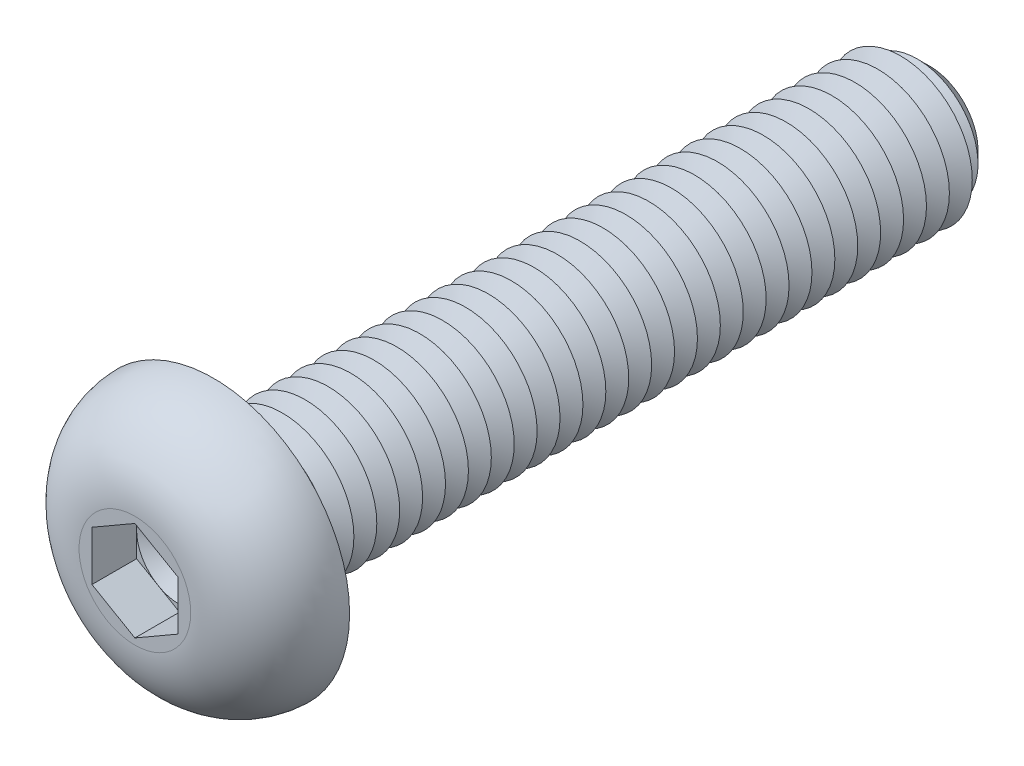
ISO-10303-21;
HEADER;
FILE_DESCRIPTION(('STEP AP214'),'2;1');
FILE_NAME('part.step','',(''),(''),'','','');
FILE_SCHEMA(('AUTOMOTIVE_DESIGN { 1 0 10303 214 1 1 1 1 }'));
ENDSEC;
DATA;
#1=APPLICATION_CONTEXT('core data for automotive mechanical design processes');
#2=APPLICATION_PROTOCOL_DEFINITION('international standard','automotive_design',2000,#1);
#3=PRODUCT_CONTEXT('',#1,'mechanical');
#4=PRODUCT('Part','Part','',(#3));
#5=PRODUCT_RELATED_PRODUCT_CATEGORY('part','',(#4));
#6=PRODUCT_DEFINITION_FORMATION('','',#4);
#7=PRODUCT_DEFINITION_CONTEXT('part definition',#1,'design');
#8=PRODUCT_DEFINITION('design','',#6,#7);
#9=PRODUCT_DEFINITION_SHAPE('','',#8);
#10=(LENGTH_UNIT() NAMED_UNIT(*) SI_UNIT(.MILLI.,.METRE.));
#11=(NAMED_UNIT(*) PLANE_ANGLE_UNIT() SI_UNIT($,.RADIAN.));
#12=(NAMED_UNIT(*) SI_UNIT($,.STERADIAN.) SOLID_ANGLE_UNIT());
#13=UNCERTAINTY_MEASURE_WITH_UNIT(LENGTH_MEASURE(1.E-05),#10,'distance_accuracy_value','');
#14=(GEOMETRIC_REPRESENTATION_CONTEXT(3) GLOBAL_UNCERTAINTY_ASSIGNED_CONTEXT((#13)) GLOBAL_UNIT_ASSIGNED_CONTEXT((#10,
#11,#12)) REPRESENTATION_CONTEXT('',''));
#15=CARTESIAN_POINT('',(0.,0.,0.));
#16=DIRECTION('',(0.,0.,1.));
#17=DIRECTION('',(1.,0.,0.));
#18=AXIS2_PLACEMENT_3D('',#15,#16,#17);
#19=CARTESIAN_POINT('',(0.,0.,1.19));
#20=DIRECTION('',(0.,0.,1.));
#21=DIRECTION('',(1.,0.,0.));
#22=AXIS2_PLACEMENT_3D('',#19,#20,#21);
#23=PLANE('',#22);
#24=CARTESIAN_POINT('',(0.,0.,1.19));
#25=DIRECTION('',(0.,0.,1.));
#26=DIRECTION('',(1.,0.,0.));
#27=AXIS2_PLACEMENT_3D('',#24,#25,#26);
#28=CIRCLE('',#27,1.5);
#29=CARTESIAN_POINT('',(1.5,0.,1.19));
#30=VERTEX_POINT('',#29);
#31=CARTESIAN_POINT('',(0.75,1.29903810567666,1.19));
#32=VERTEX_POINT('',#31);
#33=EDGE_CURVE('E117',#30,#32,#28,.T.);
#34=ORIENTED_EDGE('',*,*,#33,.F.);
#35=DIRECTION('',(0.,1.,0.));
#36=VECTOR('',#35,1.);
#37=CARTESIAN_POINT('',(1.5,-0.866025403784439,1.19));
#38=LINE('',#37,#36);
#39=CARTESIAN_POINT('',(1.5,0.86602540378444,1.19));
#40=VERTEX_POINT('',#39);
#41=EDGE_CURVE('E140',#30,#40,#38,.T.);
#42=ORIENTED_EDGE('',*,*,#41,.T.);
#43=DIRECTION('',(-0.866025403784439,0.5,0.));
#44=VECTOR('',#43,1.);
#45=CARTESIAN_POINT('',(1.5,0.86602540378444,1.19));
#46=LINE('',#45,#44);
#47=EDGE_CURVE('E135',#40,#32,#46,.T.);
#48=ORIENTED_EDGE('',*,*,#47,.T.);
#49=EDGE_LOOP('',(#34,#42,#48));
#50=FACE_BOUND('',#49,.T.);
#51=ADVANCED_FACE('F39',(#50),#23,.T.);
#52=CARTESIAN_POINT('',(0.,0.,1.19));
#53=DIRECTION('',(0.,0.,1.));
#54=DIRECTION('',(1.,0.,0.));
#55=AXIS2_PLACEMENT_3D('',#52,#53,#54);
#56=CIRCLE('',#55,1.5);
#57=CARTESIAN_POINT('',(-0.75,1.29903810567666,1.19));
#58=VERTEX_POINT('',#57);
#59=EDGE_CURVE('E11',#32,#58,#56,.T.);
#60=ORIENTED_EDGE('',*,*,#59,.F.);
#61=CARTESIAN_POINT('',(0.,1.73205080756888,1.19));
#62=VERTEX_POINT('',#61);
#63=EDGE_CURVE('E130',#32,#62,#46,.T.);
#64=ORIENTED_EDGE('',*,*,#63,.T.);
#65=DIRECTION('',(-0.866025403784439,-0.5,0.));
#66=VECTOR('',#65,1.);
#67=CARTESIAN_POINT('',(0.,1.73205080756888,1.19));
#68=LINE('',#67,#66);
#69=EDGE_CURVE('E132',#62,#58,#68,.T.);
#70=ORIENTED_EDGE('',*,*,#69,.T.);
#71=EDGE_LOOP('',(#60,#64,#70));
#72=FACE_BOUND('',#71,.T.);
#73=ADVANCED_FACE('F129',(#72),#23,.T.);
#74=CARTESIAN_POINT('',(-1.5,0.,1.19));
#75=VERTEX_POINT('',#74);
#76=EDGE_CURVE('E49',#58,#75,#56,.T.);
#77=ORIENTED_EDGE('',*,*,#76,.F.);
#78=CARTESIAN_POINT('',(-1.5,0.866025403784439,1.19));
#79=VERTEX_POINT('',#78);
#80=EDGE_CURVE('E143',#58,#79,#68,.T.);
#81=ORIENTED_EDGE('',*,*,#80,.T.);
#82=DIRECTION('',(0.,-1.,0.));
#83=VECTOR('',#82,1.);
#84=CARTESIAN_POINT('',(-1.5,0.866025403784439,1.19));
#85=LINE('',#84,#83);
#86=EDGE_CURVE('E154',#79,#75,#85,.T.);
#87=ORIENTED_EDGE('',*,*,#86,.T.);
#88=EDGE_LOOP('',(#77,#81,#87));
#89=FACE_BOUND('',#88,.T.);
#90=ADVANCED_FACE('F255',(#89),#23,.T.);
#91=CARTESIAN_POINT('',(-0.75,-1.29903810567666,1.19));
#92=VERTEX_POINT('',#91);
#93=EDGE_CURVE('E239',#75,#92,#56,.T.);
#94=ORIENTED_EDGE('',*,*,#93,.F.);
#95=CARTESIAN_POINT('',(-1.5,-0.866025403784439,1.19));
#96=VERTEX_POINT('',#95);
#97=EDGE_CURVE('E153',#75,#96,#85,.T.);
#98=ORIENTED_EDGE('',*,*,#97,.T.);
#99=DIRECTION('',(0.866025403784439,-0.5,0.));
#100=VECTOR('',#99,1.);
#101=CARTESIAN_POINT('',(-1.5,-0.866025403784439,1.19));
#102=LINE('',#101,#100);
#103=EDGE_CURVE('E159',#96,#92,#102,.T.);
#104=ORIENTED_EDGE('',*,*,#103,.T.);
#105=EDGE_LOOP('',(#94,#98,#104));
#106=FACE_BOUND('',#105,.T.);
#107=ADVANCED_FACE('F248',(#106),#23,.T.);
#108=CARTESIAN_POINT('',(0.75,-1.29903810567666,1.19));
#109=VERTEX_POINT('',#108);
#110=EDGE_CURVE('E56',#92,#109,#56,.T.);
#111=ORIENTED_EDGE('',*,*,#110,.F.);
#112=CARTESIAN_POINT('',(0.,-1.73205080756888,1.19));
#113=VERTEX_POINT('',#112);
#114=EDGE_CURVE('E158',#92,#113,#102,.T.);
#115=ORIENTED_EDGE('',*,*,#114,.T.);
#116=DIRECTION('',(0.866025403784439,0.5,0.));
#117=VECTOR('',#116,1.);
#118=CARTESIAN_POINT('',(0.,-1.73205080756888,1.19));
#119=LINE('',#118,#117);
#120=EDGE_CURVE('E164',#113,#109,#119,.T.);
#121=ORIENTED_EDGE('',*,*,#120,.T.);
#122=EDGE_LOOP('',(#111,#115,#121));
#123=FACE_BOUND('',#122,.T.);
#124=ADVANCED_FACE('F334',(#123),#23,.T.);
#125=CARTESIAN_POINT('',(0.,0.,-25.));
#126=DIRECTION('',(0.,0.,1.));
#127=DIRECTION('',(1.,0.,0.));
#128=AXIS2_PLACEMENT_3D('',#125,#126,#127);
#129=CYLINDRICAL_SURFACE('',#128,2.5);
#130=CARTESIAN_POINT('',(0.,0.,-0.400000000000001));
#131=DIRECTION('',(0.,0.,1.));
#132=DIRECTION('',(1.,0.,0.));
#133=AXIS2_PLACEMENT_3D('',#130,#131,#132);
#134=CIRCLE('',#133,2.5);
#135=CARTESIAN_POINT('',(2.5,0.,-0.400000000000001));
#136=VERTEX_POINT('',#135);
#137=EDGE_CURVE('E222',#136,#136,#134,.F.);
#138=ORIENTED_EDGE('',*,*,#137,.T.);
#139=EDGE_LOOP('',(#138));
#140=FACE_BOUND('',#139,.T.);
#141=CARTESIAN_POINT('',(0.,0.,-0.800000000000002));
#142=DIRECTION('',(0.,0.,1.));
#143=DIRECTION('',(1.,0.,0.));
#144=AXIS2_PLACEMENT_3D('',#141,#142,#143);
#145=CIRCLE('',#144,2.5);
#146=CARTESIAN_POINT('',(2.5,0.,-0.800000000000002));
#147=VERTEX_POINT('',#146);
#148=EDGE_CURVE('E149',#147,#147,#145,.T.);
#149=ORIENTED_EDGE('',*,*,#148,.T.);
#150=EDGE_LOOP('',(#149));
#151=FACE_BOUND('',#150,.T.);
#152=ADVANCED_FACE('F318',(#140,#151),#129,.T.);
#153=CARTESIAN_POINT('',(0.,4.75,0.));
#154=DIRECTION('',(0.,0.,1.));
#155=DIRECTION('',(1.,0.,0.));
#156=AXIS2_PLACEMENT_3D('',#153,#154,#155);
#157=PLANE('',#156);
#158=CARTESIAN_POINT('',(0.,0.,0.));
#159=DIRECTION('',(0.,0.,1.));
#160=DIRECTION('',(1.,0.,0.));
#161=AXIS2_PLACEMENT_3D('',#158,#159,#160);
#162=CIRCLE('',#161,2.9);
#163=CARTESIAN_POINT('',(2.9,0.,0.));
#164=VERTEX_POINT('',#163);
#165=EDGE_CURVE('E231',#164,#164,#162,.T.);
#166=ORIENTED_EDGE('',*,*,#165,.T.);
#167=EDGE_LOOP('',(#166));
#168=FACE_BOUND('',#167,.T.);
#169=CARTESIAN_POINT('',(0.,0.,0.));
#170=DIRECTION('',(0.,0.,1.));
#171=DIRECTION('',(1.,0.,0.));
#172=AXIS2_PLACEMENT_3D('',#169,#170,#171);
#173=CIRCLE('',#172,4.75);
#174=CARTESIAN_POINT('',(4.75,0.,0.));
#175=VERTEX_POINT('',#174);
#176=EDGE_CURVE('E196',#175,#175,#173,.T.);
#177=ORIENTED_EDGE('',*,*,#176,.F.);
#178=EDGE_LOOP('',(#177));
#179=FACE_BOUND('',#178,.T.);
#180=ADVANCED_FACE('F364',(#168,#179),#157,.F.);
#181=CARTESIAN_POINT('',(0.,0.,2.75));
#182=DIRECTION('',(0.,0.,-1.));
#183=DIRECTION('',(-1.,0.,0.));
#184=AXIS2_PLACEMENT_3D('',#181,#182,#183);
#185=PLANE('',#184);
#186=DIRECTION('',(-0.866025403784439,-0.5,0.));
#187=VECTOR('',#186,1.);
#188=CARTESIAN_POINT('',(0.,1.73205080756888,2.75));
#189=LINE('',#188,#187);
#190=CARTESIAN_POINT('',(0.,1.73205080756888,2.75));
#191=VERTEX_POINT('',#190);
#192=CARTESIAN_POINT('',(-1.5,0.866025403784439,2.75));
#193=VERTEX_POINT('',#192);
#194=EDGE_CURVE('E174',#191,#193,#189,.T.);
#195=ORIENTED_EDGE('',*,*,#194,.F.);
#196=DIRECTION('',(-0.866025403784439,0.5,0.));
#197=VECTOR('',#196,1.);
#198=CARTESIAN_POINT('',(1.5,0.86602540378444,2.75));
#199=LINE('',#198,#197);
#200=CARTESIAN_POINT('',(1.5,0.86602540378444,2.75));
#201=VERTEX_POINT('',#200);
#202=EDGE_CURVE('E64',#201,#191,#199,.T.);
#203=ORIENTED_EDGE('',*,*,#202,.F.);
#204=DIRECTION('',(0.,1.,0.));
#205=VECTOR('',#204,1.);
#206=CARTESIAN_POINT('',(1.5,-0.866025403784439,2.75));
#207=LINE('',#206,#205);
#208=CARTESIAN_POINT('',(1.5,-0.866025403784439,2.75));
#209=VERTEX_POINT('',#208);
#210=EDGE_CURVE('E138',#209,#201,#207,.T.);
#211=ORIENTED_EDGE('',*,*,#210,.F.);
#212=DIRECTION('',(0.866025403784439,0.5,0.));
#213=VECTOR('',#212,1.);
#214=CARTESIAN_POINT('',(0.,-1.73205080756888,2.75));
#215=LINE('',#214,#213);
#216=CARTESIAN_POINT('',(0.,-1.73205080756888,2.75));
#217=VERTEX_POINT('',#216);
#218=EDGE_CURVE('E186',#217,#209,#215,.T.);
#219=ORIENTED_EDGE('',*,*,#218,.F.);
#220=DIRECTION('',(0.866025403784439,-0.5,0.));
#221=VECTOR('',#220,1.);
#222=CARTESIAN_POINT('',(-1.5,-0.866025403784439,2.75));
#223=LINE('',#222,#221);
#224=CARTESIAN_POINT('',(-1.5,-0.866025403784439,2.75));
#225=VERTEX_POINT('',#224);
#226=EDGE_CURVE('E182',#225,#217,#223,.T.);
#227=ORIENTED_EDGE('',*,*,#226,.F.);
#228=DIRECTION('',(0.,-1.,0.));
#229=VECTOR('',#228,1.);
#230=CARTESIAN_POINT('',(-1.5,0.866025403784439,2.75));
#231=LINE('',#230,#229);
#232=EDGE_CURVE('E178',#193,#225,#231,.T.);
#233=ORIENTED_EDGE('',*,*,#232,.F.);
#234=EDGE_LOOP('',(#195,#203,#211,#219,#227,#233));
#235=FACE_BOUND('',#234,.T.);
#236=CARTESIAN_POINT('',(0.,0.,2.75));
#237=DIRECTION('',(0.,0.,1.));
#238=DIRECTION('',(1.,0.,0.));
#239=AXIS2_PLACEMENT_3D('',#236,#237,#238);
#240=CIRCLE('',#239,1.95044646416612);
#241=CARTESIAN_POINT('',(1.95044646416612,0.,2.75));
#242=VERTEX_POINT('',#241);
#243=EDGE_CURVE('E214',#242,#242,#240,.T.);
#244=ORIENTED_EDGE('',*,*,#243,.T.);
#245=EDGE_LOOP('',(#244));
#246=FACE_BOUND('',#245,.T.);
#247=ADVANCED_FACE('F264',(#235,#246),#185,.F.);
#248=CARTESIAN_POINT('',(0.,0.,-0.0500000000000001));
#249=DIRECTION('',(0.,0.,1.));
#250=DIRECTION('',(1.,0.,0.));
#251=AXIS2_PLACEMENT_3D('',#248,#249,#250);
#252=DEGENERATE_TOROIDAL_SURFACE('',#251,1.95044646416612,2.8,.T.);
#253=ORIENTED_EDGE('',*,*,#243,.F.);
#254=EDGE_LOOP('',(#253));
#255=FACE_BOUND('',#254,.T.);
#256=ORIENTED_EDGE('',*,*,#176,.T.);
#257=EDGE_LOOP('',(#256));
#258=FACE_BOUND('',#257,.T.);
#259=ADVANCED_FACE('F358',(#255,#258),#252,.T.);
#260=CARTESIAN_POINT('',(1.5,0.86602540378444,1.19));
#261=DIRECTION('',(0.5,0.866025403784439,0.));
#262=DIRECTION('',(-0.866025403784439,0.5,0.));
#263=AXIS2_PLACEMENT_3D('',#260,#261,#262);
#264=PLANE('',#263);
#265=ORIENTED_EDGE('',*,*,#202,.T.);
#266=DIRECTION('',(0.,0.,1.));
#267=VECTOR('',#266,1.);
#268=CARTESIAN_POINT('',(0.,1.73205080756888,1.19));
#269=LINE('',#268,#267);
#270=EDGE_CURVE('E136',#62,#191,#269,.T.);
#271=ORIENTED_EDGE('',*,*,#270,.F.);
#272=ORIENTED_EDGE('',*,*,#63,.F.);
#273=ORIENTED_EDGE('',*,*,#47,.F.);
#274=DIRECTION('',(0.,0.,1.));
#275=VECTOR('',#274,1.);
#276=CARTESIAN_POINT('',(1.5,0.86602540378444,1.19));
#277=LINE('',#276,#275);
#278=EDGE_CURVE('E193',#40,#201,#277,.T.);
#279=ORIENTED_EDGE('',*,*,#278,.T.);
#280=EDGE_LOOP('',(#265,#271,#272,#273,#279));
#281=FACE_BOUND('',#280,.T.);
#282=ADVANCED_FACE('F134',(#281),#264,.F.);
#283=CARTESIAN_POINT('',(1.5,-0.866025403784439,1.19));
#284=DIRECTION('',(1.,0.,0.));
#285=DIRECTION('',(0.,1.,0.));
#286=AXIS2_PLACEMENT_3D('',#283,#284,#285);
#287=PLANE('',#286);
#288=ORIENTED_EDGE('',*,*,#210,.T.);
#289=ORIENTED_EDGE('',*,*,#278,.F.);
#290=ORIENTED_EDGE('',*,*,#41,.F.);
#291=CARTESIAN_POINT('',(1.5,-0.866025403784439,1.19));
#292=VERTEX_POINT('',#291);
#293=EDGE_CURVE('E168',#292,#30,#38,.T.);
#294=ORIENTED_EDGE('',*,*,#293,.F.);
#295=DIRECTION('',(0.,0.,1.));
#296=VECTOR('',#295,1.);
#297=CARTESIAN_POINT('',(1.5,-0.866025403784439,1.19));
#298=LINE('',#297,#296);
#299=EDGE_CURVE('E197',#292,#209,#298,.T.);
#300=ORIENTED_EDGE('',*,*,#299,.T.);
#301=EDGE_LOOP('',(#288,#289,#290,#294,#300));
#302=FACE_BOUND('',#301,.T.);
#303=ADVANCED_FACE('F342',(#302),#287,.F.);
#304=CARTESIAN_POINT('',(0.,-1.73205080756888,1.19));
#305=DIRECTION('',(0.5,-0.866025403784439,0.));
#306=DIRECTION('',(0.866025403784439,0.5,0.));
#307=AXIS2_PLACEMENT_3D('',#304,#305,#306);
#308=PLANE('',#307);
#309=ORIENTED_EDGE('',*,*,#218,.T.);
#310=ORIENTED_EDGE('',*,*,#299,.F.);
#311=EDGE_CURVE('E163',#109,#292,#119,.T.);
#312=ORIENTED_EDGE('',*,*,#311,.F.);
#313=ORIENTED_EDGE('',*,*,#120,.F.);
#314=DIRECTION('',(0.,0.,1.));
#315=VECTOR('',#314,1.);
#316=CARTESIAN_POINT('',(0.,-1.73205080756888,1.19));
#317=LINE('',#316,#315);
#318=EDGE_CURVE('E200',#113,#217,#317,.T.);
#319=ORIENTED_EDGE('',*,*,#318,.T.);
#320=EDGE_LOOP('',(#309,#310,#312,#313,#319));
#321=FACE_BOUND('',#320,.T.);
#322=ADVANCED_FACE('F345',(#321),#308,.F.);
#323=CARTESIAN_POINT('',(-1.5,-0.866025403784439,1.19));
#324=DIRECTION('',(-0.5,-0.866025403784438,0.));
#325=DIRECTION('',(0.866025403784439,-0.5,0.));
#326=AXIS2_PLACEMENT_3D('',#323,#324,#325);
#327=PLANE('',#326);
#328=ORIENTED_EDGE('',*,*,#226,.T.);
#329=ORIENTED_EDGE('',*,*,#318,.F.);
#330=ORIENTED_EDGE('',*,*,#114,.F.);
#331=ORIENTED_EDGE('',*,*,#103,.F.);
#332=DIRECTION('',(0.,0.,1.));
#333=VECTOR('',#332,1.);
#334=CARTESIAN_POINT('',(-1.5,-0.866025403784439,1.19));
#335=LINE('',#334,#333);
#336=EDGE_CURVE('E203',#96,#225,#335,.T.);
#337=ORIENTED_EDGE('',*,*,#336,.T.);
#338=EDGE_LOOP('',(#328,#329,#330,#331,#337));
#339=FACE_BOUND('',#338,.T.);
#340=ADVANCED_FACE('F269',(#339),#327,.F.);
#341=CARTESIAN_POINT('',(-1.5,0.866025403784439,1.19));
#342=DIRECTION('',(-1.,0.,0.));
#343=DIRECTION('',(0.,-1.,0.));
#344=AXIS2_PLACEMENT_3D('',#341,#342,#343);
#345=PLANE('',#344);
#346=ORIENTED_EDGE('',*,*,#232,.T.);
#347=ORIENTED_EDGE('',*,*,#336,.F.);
#348=ORIENTED_EDGE('',*,*,#97,.F.);
#349=ORIENTED_EDGE('',*,*,#86,.F.);
#350=DIRECTION('',(0.,0.,1.));
#351=VECTOR('',#350,1.);
#352=CARTESIAN_POINT('',(-1.5,0.866025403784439,1.19));
#353=LINE('',#352,#351);
#354=EDGE_CURVE('E206',#79,#193,#353,.T.);
#355=ORIENTED_EDGE('',*,*,#354,.T.);
#356=EDGE_LOOP('',(#346,#347,#348,#349,#355));
#357=FACE_BOUND('',#356,.T.);
#358=ADVANCED_FACE('F253',(#357),#345,.F.);
#359=CARTESIAN_POINT('',(0.,1.73205080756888,1.19));
#360=DIRECTION('',(-0.5,0.866025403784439,0.));
#361=DIRECTION('',(-0.866025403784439,-0.5,0.));
#362=AXIS2_PLACEMENT_3D('',#359,#360,#361);
#363=PLANE('',#362);
#364=ORIENTED_EDGE('',*,*,#194,.T.);
#365=ORIENTED_EDGE('',*,*,#354,.F.);
#366=ORIENTED_EDGE('',*,*,#80,.F.);
#367=ORIENTED_EDGE('',*,*,#69,.F.);
#368=ORIENTED_EDGE('',*,*,#270,.T.);
#369=EDGE_LOOP('',(#364,#365,#366,#367,#368));
#370=FACE_BOUND('',#369,.T.);
#371=ADVANCED_FACE('F258',(#370),#363,.F.);
#372=EDGE_CURVE('E43',#109,#30,#56,.T.);
#373=ORIENTED_EDGE('',*,*,#372,.F.);
#374=ORIENTED_EDGE('',*,*,#311,.T.);
#375=ORIENTED_EDGE('',*,*,#293,.T.);
#376=EDGE_LOOP('',(#373,#374,#375));
#377=FACE_BOUND('',#376,.T.);
#378=ADVANCED_FACE('F323',(#377),#23,.T.);
#379=CARTESIAN_POINT('',(0.,0.,-0.800000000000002));
#380=DIRECTION('',(0.,0.,1.));
#381=DIRECTION('',(1.,0.,0.));
#382=AXIS2_PLACEMENT_3D('',#379,#380,#381);
#383=CONICAL_SURFACE('',#382,2.5,1.0471975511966);
#384=CARTESIAN_POINT('',(0.,0.,-1.2));
#385=DIRECTION('',(0.,0.,1.));
#386=DIRECTION('',(1.,0.,0.));
#387=AXIS2_PLACEMENT_3D('',#384,#385,#386);
#388=CIRCLE('',#387,1.80717967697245);
#389=CARTESIAN_POINT('',(1.80717967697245,0.,-1.2));
#390=VERTEX_POINT('',#389);
#391=EDGE_CURVE('E303',#390,#390,#388,.T.);
#392=ORIENTED_EDGE('',*,*,#391,.T.);
#393=EDGE_LOOP('',(#392));
#394=FACE_BOUND('',#393,.T.);
#395=ORIENTED_EDGE('',*,*,#148,.F.);
#396=EDGE_LOOP('',(#395));
#397=FACE_BOUND('',#396,.T.);
#398=ADVANCED_FACE('F320',(#394,#397),#383,.T.);
#399=CARTESIAN_POINT('',(0.,0.,-1.2));
#400=DIRECTION('',(0.,0.,-1.));
#401=DIRECTION('',(-1.,0.,0.));
#402=AXIS2_PLACEMENT_3D('',#399,#400,#401);
#403=CONICAL_SURFACE('',#402,1.80717967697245,1.04719755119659);
#404=CARTESIAN_POINT('',(0.,0.,-1.6));
#405=DIRECTION('',(0.,0.,1.));
#406=DIRECTION('',(1.,0.,0.));
#407=AXIS2_PLACEMENT_3D('',#404,#405,#406);
#408=CIRCLE('',#407,2.5);
#409=CARTESIAN_POINT('',(2.5,0.,-1.6));
#410=VERTEX_POINT('',#409);
#411=EDGE_CURVE('E296',#410,#410,#408,.T.);
#412=ORIENTED_EDGE('',*,*,#411,.T.);
#413=EDGE_LOOP('',(#412));
#414=FACE_BOUND('',#413,.T.);
#415=ORIENTED_EDGE('',*,*,#391,.F.);
#416=EDGE_LOOP('',(#415));
#417=FACE_BOUND('',#416,.T.);
#418=ADVANCED_FACE('F322',(#414,#417),#403,.T.);
#419=CARTESIAN_POINT('',(0.,0.,-1.6));
#420=DIRECTION('',(0.,0.,1.));
#421=DIRECTION('',(1.,0.,0.));
#422=AXIS2_PLACEMENT_3D('',#419,#420,#421);
#423=CONICAL_SURFACE('',#422,2.5,1.0471975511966);
#424=CARTESIAN_POINT('',(0.,0.,-2.));
#425=DIRECTION('',(0.,0.,1.));
#426=DIRECTION('',(1.,0.,0.));
#427=AXIS2_PLACEMENT_3D('',#424,#425,#426);
#428=CIRCLE('',#427,1.80717967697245);
#429=CARTESIAN_POINT('',(1.80717967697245,0.,-2.));
#430=VERTEX_POINT('',#429);
#431=EDGE_CURVE('E294',#430,#430,#428,.T.);
#432=ORIENTED_EDGE('',*,*,#431,.T.);
#433=EDGE_LOOP('',(#432));
#434=FACE_BOUND('',#433,.T.);
#435=ORIENTED_EDGE('',*,*,#411,.F.);
#436=EDGE_LOOP('',(#435));
#437=FACE_BOUND('',#436,.T.);
#438=ADVANCED_FACE('F329',(#434,#437),#423,.T.);
#439=CARTESIAN_POINT('',(0.,0.,-2.));
#440=DIRECTION('',(0.,0.,-1.));
#441=DIRECTION('',(-1.,0.,0.));
#442=AXIS2_PLACEMENT_3D('',#439,#440,#441);
#443=CONICAL_SURFACE('',#442,1.80717967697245,1.04719755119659);
#444=CARTESIAN_POINT('',(0.,0.,-2.4));
#445=DIRECTION('',(0.,0.,1.));
#446=DIRECTION('',(1.,0.,0.));
#447=AXIS2_PLACEMENT_3D('',#444,#445,#446);
#448=CIRCLE('',#447,2.5);
#449=CARTESIAN_POINT('',(2.5,0.,-2.4));
#450=VERTEX_POINT('',#449);
#451=EDGE_CURVE('E297',#450,#450,#448,.T.);
#452=ORIENTED_EDGE('',*,*,#451,.T.);
#453=EDGE_LOOP('',(#452));
#454=FACE_BOUND('',#453,.T.);
#455=ORIENTED_EDGE('',*,*,#431,.F.);
#456=EDGE_LOOP('',(#455));
#457=FACE_BOUND('',#456,.T.);
#458=ADVANCED_FACE('F596',(#454,#457),#443,.T.);
#459=CARTESIAN_POINT('',(0.,0.,-2.4));
#460=DIRECTION('',(0.,0.,1.));
#461=DIRECTION('',(1.,0.,0.));
#462=AXIS2_PLACEMENT_3D('',#459,#460,#461);
#463=CONICAL_SURFACE('',#462,2.5,1.0471975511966);
#464=CARTESIAN_POINT('',(0.,0.,-2.8));
#465=DIRECTION('',(0.,0.,1.));
#466=DIRECTION('',(1.,0.,0.));
#467=AXIS2_PLACEMENT_3D('',#464,#465,#466);
#468=CIRCLE('',#467,1.80717967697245);
#469=CARTESIAN_POINT('',(1.80717967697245,0.,-2.8));
#470=VERTEX_POINT('',#469);
#471=EDGE_CURVE('E306',#470,#470,#468,.T.);
#472=ORIENTED_EDGE('',*,*,#471,.T.);
#473=EDGE_LOOP('',(#472));
#474=FACE_BOUND('',#473,.T.);
#475=ORIENTED_EDGE('',*,*,#451,.F.);
#476=EDGE_LOOP('',(#475));
#477=FACE_BOUND('',#476,.T.);
#478=ADVANCED_FACE('F581',(#474,#477),#463,.T.);
#479=CARTESIAN_POINT('',(0.,0.,-2.8));
#480=DIRECTION('',(0.,0.,-1.));
#481=DIRECTION('',(-1.,0.,0.));
#482=AXIS2_PLACEMENT_3D('',#479,#480,#481);
#483=CONICAL_SURFACE('',#482,1.80717967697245,1.04719755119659);
#484=CARTESIAN_POINT('',(0.,0.,-3.2));
#485=DIRECTION('',(0.,0.,1.));
#486=DIRECTION('',(1.,0.,0.));
#487=AXIS2_PLACEMENT_3D('',#484,#485,#486);
#488=CIRCLE('',#487,2.5);
#489=CARTESIAN_POINT('',(2.5,0.,-3.2));
#490=VERTEX_POINT('',#489);
#491=EDGE_CURVE('E574',#490,#490,#488,.T.);
#492=ORIENTED_EDGE('',*,*,#491,.T.);
#493=EDGE_LOOP('',(#492));
#494=FACE_BOUND('',#493,.T.);
#495=ORIENTED_EDGE('',*,*,#471,.F.);
#496=EDGE_LOOP('',(#495));
#497=FACE_BOUND('',#496,.T.);
#498=ADVANCED_FACE('F584',(#494,#497),#483,.T.);
#499=CARTESIAN_POINT('',(0.,0.,-3.2));
#500=DIRECTION('',(0.,0.,1.));
#501=DIRECTION('',(1.,0.,0.));
#502=AXIS2_PLACEMENT_3D('',#499,#500,#501);
#503=CONICAL_SURFACE('',#502,2.5,1.0471975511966);
#504=CARTESIAN_POINT('',(0.,0.,-3.6));
#505=DIRECTION('',(0.,0.,1.));
#506=DIRECTION('',(1.,0.,0.));
#507=AXIS2_PLACEMENT_3D('',#504,#505,#506);
#508=CIRCLE('',#507,1.80717967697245);
#509=CARTESIAN_POINT('',(1.80717967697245,0.,-3.6));
#510=VERTEX_POINT('',#509);
#511=EDGE_CURVE('E570',#510,#510,#508,.T.);
#512=ORIENTED_EDGE('',*,*,#511,.T.);
#513=EDGE_LOOP('',(#512));
#514=FACE_BOUND('',#513,.T.);
#515=ORIENTED_EDGE('',*,*,#491,.F.);
#516=EDGE_LOOP('',(#515));
#517=FACE_BOUND('',#516,.T.);
#518=ADVANCED_FACE('F586',(#514,#517),#503,.T.);
#519=CARTESIAN_POINT('',(0.,0.,-3.6));
#520=DIRECTION('',(0.,0.,-1.));
#521=DIRECTION('',(-1.,0.,0.));
#522=AXIS2_PLACEMENT_3D('',#519,#520,#521);
#523=CONICAL_SURFACE('',#522,1.80717967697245,1.04719755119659);
#524=CARTESIAN_POINT('',(0.,0.,-4.));
#525=DIRECTION('',(0.,0.,1.));
#526=DIRECTION('',(1.,0.,0.));
#527=AXIS2_PLACEMENT_3D('',#524,#525,#526);
#528=CIRCLE('',#527,2.5);
#529=CARTESIAN_POINT('',(2.5,0.,-4.));
#530=VERTEX_POINT('',#529);
#531=EDGE_CURVE('E566',#530,#530,#528,.T.);
#532=ORIENTED_EDGE('',*,*,#531,.T.);
#533=EDGE_LOOP('',(#532));
#534=FACE_BOUND('',#533,.T.);
#535=ORIENTED_EDGE('',*,*,#511,.F.);
#536=EDGE_LOOP('',(#535));
#537=FACE_BOUND('',#536,.T.);
#538=ADVANCED_FACE('F593',(#534,#537),#523,.T.);
#539=CARTESIAN_POINT('',(0.,0.,-4.));
#540=DIRECTION('',(0.,0.,1.));
#541=DIRECTION('',(1.,0.,0.));
#542=AXIS2_PLACEMENT_3D('',#539,#540,#541);
#543=CONICAL_SURFACE('',#542,2.5,1.0471975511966);
#544=CARTESIAN_POINT('',(0.,0.,-4.4));
#545=DIRECTION('',(0.,0.,1.));
#546=DIRECTION('',(1.,0.,0.));
#547=AXIS2_PLACEMENT_3D('',#544,#545,#546);
#548=CIRCLE('',#547,1.80717967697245);
#549=CARTESIAN_POINT('',(1.80717967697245,0.,-4.4));
#550=VERTEX_POINT('',#549);
#551=EDGE_CURVE('E562',#550,#550,#548,.T.);
#552=ORIENTED_EDGE('',*,*,#551,.T.);
#553=EDGE_LOOP('',(#552));
#554=FACE_BOUND('',#553,.T.);
#555=ORIENTED_EDGE('',*,*,#531,.F.);
#556=EDGE_LOOP('',(#555));
#557=FACE_BOUND('',#556,.T.);
#558=ADVANCED_FACE('F632',(#554,#557),#543,.T.);
#559=CARTESIAN_POINT('',(0.,0.,-4.4));
#560=DIRECTION('',(0.,0.,-1.));
#561=DIRECTION('',(-1.,0.,0.));
#562=AXIS2_PLACEMENT_3D('',#559,#560,#561);
#563=CONICAL_SURFACE('',#562,1.80717967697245,1.04719755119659);
#564=CARTESIAN_POINT('',(0.,0.,-4.8));
#565=DIRECTION('',(0.,0.,1.));
#566=DIRECTION('',(1.,0.,0.));
#567=AXIS2_PLACEMENT_3D('',#564,#565,#566);
#568=CIRCLE('',#567,2.5);
#569=CARTESIAN_POINT('',(2.5,0.,-4.8));
#570=VERTEX_POINT('',#569);
#571=EDGE_CURVE('E558',#570,#570,#568,.T.);
#572=ORIENTED_EDGE('',*,*,#571,.T.);
#573=EDGE_LOOP('',(#572));
#574=FACE_BOUND('',#573,.T.);
#575=ORIENTED_EDGE('',*,*,#551,.F.);
#576=EDGE_LOOP('',(#575));
#577=FACE_BOUND('',#576,.T.);
#578=ADVANCED_FACE('F640',(#574,#577),#563,.T.);
#579=CARTESIAN_POINT('',(0.,0.,-4.8));
#580=DIRECTION('',(0.,0.,1.));
#581=DIRECTION('',(1.,0.,0.));
#582=AXIS2_PLACEMENT_3D('',#579,#580,#581);
#583=CONICAL_SURFACE('',#582,2.5,1.0471975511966);
#584=CARTESIAN_POINT('',(0.,0.,-5.2));
#585=DIRECTION('',(0.,0.,1.));
#586=DIRECTION('',(1.,0.,0.));
#587=AXIS2_PLACEMENT_3D('',#584,#585,#586);
#588=CIRCLE('',#587,1.80717967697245);
#589=CARTESIAN_POINT('',(1.80717967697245,0.,-5.2));
#590=VERTEX_POINT('',#589);
#591=EDGE_CURVE('E554',#590,#590,#588,.T.);
#592=ORIENTED_EDGE('',*,*,#591,.T.);
#593=EDGE_LOOP('',(#592));
#594=FACE_BOUND('',#593,.T.);
#595=ORIENTED_EDGE('',*,*,#571,.F.);
#596=EDGE_LOOP('',(#595));
#597=FACE_BOUND('',#596,.T.);
#598=ADVANCED_FACE('F649',(#594,#597),#583,.T.);
#599=CARTESIAN_POINT('',(0.,0.,-5.2));
#600=DIRECTION('',(0.,0.,-1.));
#601=DIRECTION('',(-1.,0.,0.));
#602=AXIS2_PLACEMENT_3D('',#599,#600,#601);
#603=CONICAL_SURFACE('',#602,1.80717967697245,1.04719755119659);
#604=CARTESIAN_POINT('',(0.,0.,-5.6));
#605=DIRECTION('',(0.,0.,1.));
#606=DIRECTION('',(1.,0.,0.));
#607=AXIS2_PLACEMENT_3D('',#604,#605,#606);
#608=CIRCLE('',#607,2.5);
#609=CARTESIAN_POINT('',(2.5,0.,-5.6));
#610=VERTEX_POINT('',#609);
#611=EDGE_CURVE('E550',#610,#610,#608,.T.);
#612=ORIENTED_EDGE('',*,*,#611,.T.);
#613=EDGE_LOOP('',(#612));
#614=FACE_BOUND('',#613,.T.);
#615=ORIENTED_EDGE('',*,*,#591,.F.);
#616=EDGE_LOOP('',(#615));
#617=FACE_BOUND('',#616,.T.);
#618=ADVANCED_FACE('F658',(#614,#617),#603,.T.);
#619=CARTESIAN_POINT('',(0.,0.,-5.6));
#620=DIRECTION('',(0.,0.,1.));
#621=DIRECTION('',(1.,0.,0.));
#622=AXIS2_PLACEMENT_3D('',#619,#620,#621);
#623=CONICAL_SURFACE('',#622,2.5,1.0471975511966);
#624=CARTESIAN_POINT('',(0.,0.,-6.));
#625=DIRECTION('',(0.,0.,1.));
#626=DIRECTION('',(1.,0.,0.));
#627=AXIS2_PLACEMENT_3D('',#624,#625,#626);
#628=CIRCLE('',#627,1.80717967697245);
#629=CARTESIAN_POINT('',(1.80717967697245,0.,-6.));
#630=VERTEX_POINT('',#629);
#631=EDGE_CURVE('E291',#630,#630,#628,.T.);
#632=ORIENTED_EDGE('',*,*,#631,.T.);
#633=EDGE_LOOP('',(#632));
#634=FACE_BOUND('',#633,.T.);
#635=ORIENTED_EDGE('',*,*,#611,.F.);
#636=EDGE_LOOP('',(#635));
#637=FACE_BOUND('',#636,.T.);
#638=ADVANCED_FACE('F667',(#634,#637),#623,.T.);
#639=CARTESIAN_POINT('',(0.,0.,-6.));
#640=DIRECTION('',(0.,0.,-1.));
#641=DIRECTION('',(-1.,0.,0.));
#642=AXIS2_PLACEMENT_3D('',#639,#640,#641);
#643=CONICAL_SURFACE('',#642,1.80717967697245,1.04719755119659);
#644=CARTESIAN_POINT('',(0.,0.,-6.4));
#645=DIRECTION('',(0.,0.,1.));
#646=DIRECTION('',(1.,0.,0.));
#647=AXIS2_PLACEMENT_3D('',#644,#645,#646);
#648=CIRCLE('',#647,2.5);
#649=CARTESIAN_POINT('',(2.5,0.,-6.4));
#650=VERTEX_POINT('',#649);
#651=EDGE_CURVE('E288',#650,#650,#648,.T.);
#652=ORIENTED_EDGE('',*,*,#651,.T.);
#653=EDGE_LOOP('',(#652));
#654=FACE_BOUND('',#653,.T.);
#655=ORIENTED_EDGE('',*,*,#631,.F.);
#656=EDGE_LOOP('',(#655));
#657=FACE_BOUND('',#656,.T.);
#658=ADVANCED_FACE('F676',(#654,#657),#643,.T.);
#659=CARTESIAN_POINT('',(0.,0.,-6.4));
#660=DIRECTION('',(0.,0.,1.));
#661=DIRECTION('',(1.,0.,0.));
#662=AXIS2_PLACEMENT_3D('',#659,#660,#661);
#663=CONICAL_SURFACE('',#662,2.5,1.0471975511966);
#664=CARTESIAN_POINT('',(0.,0.,-6.8));
#665=DIRECTION('',(0.,0.,1.));
#666=DIRECTION('',(1.,0.,0.));
#667=AXIS2_PLACEMENT_3D('',#664,#665,#666);
#668=CIRCLE('',#667,1.80717967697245);
#669=CARTESIAN_POINT('',(1.80717967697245,0.,-6.8));
#670=VERTEX_POINT('',#669);
#671=EDGE_CURVE('E292',#670,#670,#668,.T.);
#672=ORIENTED_EDGE('',*,*,#671,.T.);
#673=EDGE_LOOP('',(#672));
#674=FACE_BOUND('',#673,.T.);
#675=ORIENTED_EDGE('',*,*,#651,.F.);
#676=EDGE_LOOP('',(#675));
#677=FACE_BOUND('',#676,.T.);
#678=ADVANCED_FACE('F685',(#674,#677),#663,.T.);
#679=CARTESIAN_POINT('',(0.,0.,-6.8));
#680=DIRECTION('',(0.,0.,-1.));
#681=DIRECTION('',(-1.,0.,0.));
#682=AXIS2_PLACEMENT_3D('',#679,#680,#681);
#683=CONICAL_SURFACE('',#682,1.80717967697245,1.04719755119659);
#684=CARTESIAN_POINT('',(0.,0.,-7.2));
#685=DIRECTION('',(0.,0.,1.));
#686=DIRECTION('',(1.,0.,0.));
#687=AXIS2_PLACEMENT_3D('',#684,#685,#686);
#688=CIRCLE('',#687,2.5);
#689=CARTESIAN_POINT('',(2.5,0.,-7.2));
#690=VERTEX_POINT('',#689);
#691=EDGE_CURVE('E542',#690,#690,#688,.T.);
#692=ORIENTED_EDGE('',*,*,#691,.T.);
#693=EDGE_LOOP('',(#692));
#694=FACE_BOUND('',#693,.T.);
#695=ORIENTED_EDGE('',*,*,#671,.F.);
#696=EDGE_LOOP('',(#695));
#697=FACE_BOUND('',#696,.T.);
#698=ADVANCED_FACE('F694',(#694,#697),#683,.T.);
#699=CARTESIAN_POINT('',(0.,0.,-7.2));
#700=DIRECTION('',(0.,0.,1.));
#701=DIRECTION('',(1.,0.,0.));
#702=AXIS2_PLACEMENT_3D('',#699,#700,#701);
#703=CONICAL_SURFACE('',#702,2.5,1.0471975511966);
#704=CARTESIAN_POINT('',(0.,0.,-7.6));
#705=DIRECTION('',(0.,0.,1.));
#706=DIRECTION('',(1.,0.,0.));
#707=AXIS2_PLACEMENT_3D('',#704,#705,#706);
#708=CIRCLE('',#707,1.80717967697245);
#709=CARTESIAN_POINT('',(1.80717967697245,0.,-7.6));
#710=VERTEX_POINT('',#709);
#711=EDGE_CURVE('E538',#710,#710,#708,.T.);
#712=ORIENTED_EDGE('',*,*,#711,.T.);
#713=EDGE_LOOP('',(#712));
#714=FACE_BOUND('',#713,.T.);
#715=ORIENTED_EDGE('',*,*,#691,.F.);
#716=EDGE_LOOP('',(#715));
#717=FACE_BOUND('',#716,.T.);
#718=ADVANCED_FACE('F703',(#714,#717),#703,.T.);
#719=CARTESIAN_POINT('',(0.,0.,-7.6));
#720=DIRECTION('',(0.,0.,-1.));
#721=DIRECTION('',(-1.,0.,0.));
#722=AXIS2_PLACEMENT_3D('',#719,#720,#721);
#723=CONICAL_SURFACE('',#722,1.80717967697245,1.04719755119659);
#724=CARTESIAN_POINT('',(0.,0.,-8.));
#725=DIRECTION('',(0.,0.,1.));
#726=DIRECTION('',(1.,0.,0.));
#727=AXIS2_PLACEMENT_3D('',#724,#725,#726);
#728=CIRCLE('',#727,2.5);
#729=CARTESIAN_POINT('',(2.5,0.,-8.));
#730=VERTEX_POINT('',#729);
#731=EDGE_CURVE('E534',#730,#730,#728,.T.);
#732=ORIENTED_EDGE('',*,*,#731,.T.);
#733=EDGE_LOOP('',(#732));
#734=FACE_BOUND('',#733,.T.);
#735=ORIENTED_EDGE('',*,*,#711,.F.);
#736=EDGE_LOOP('',(#735));
#737=FACE_BOUND('',#736,.T.);
#738=ADVANCED_FACE('F712',(#734,#737),#723,.T.);
#739=CARTESIAN_POINT('',(0.,0.,-8.));
#740=DIRECTION('',(0.,0.,1.));
#741=DIRECTION('',(1.,0.,0.));
#742=AXIS2_PLACEMENT_3D('',#739,#740,#741);
#743=CONICAL_SURFACE('',#742,2.5,1.0471975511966);
#744=CARTESIAN_POINT('',(0.,0.,-8.4));
#745=DIRECTION('',(0.,0.,1.));
#746=DIRECTION('',(1.,0.,0.));
#747=AXIS2_PLACEMENT_3D('',#744,#745,#746);
#748=CIRCLE('',#747,1.80717967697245);
#749=CARTESIAN_POINT('',(1.80717967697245,0.,-8.4));
#750=VERTEX_POINT('',#749);
#751=EDGE_CURVE('E530',#750,#750,#748,.T.);
#752=ORIENTED_EDGE('',*,*,#751,.T.);
#753=EDGE_LOOP('',(#752));
#754=FACE_BOUND('',#753,.T.);
#755=ORIENTED_EDGE('',*,*,#731,.F.);
#756=EDGE_LOOP('',(#755));
#757=FACE_BOUND('',#756,.T.);
#758=ADVANCED_FACE('F721',(#754,#757),#743,.T.);
#759=CARTESIAN_POINT('',(0.,0.,-8.4));
#760=DIRECTION('',(0.,0.,-1.));
#761=DIRECTION('',(-1.,0.,0.));
#762=AXIS2_PLACEMENT_3D('',#759,#760,#761);
#763=CONICAL_SURFACE('',#762,1.80717967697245,1.04719755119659);
#764=CARTESIAN_POINT('',(0.,0.,-8.8));
#765=DIRECTION('',(0.,0.,1.));
#766=DIRECTION('',(1.,0.,0.));
#767=AXIS2_PLACEMENT_3D('',#764,#765,#766);
#768=CIRCLE('',#767,2.5);
#769=CARTESIAN_POINT('',(2.5,0.,-8.8));
#770=VERTEX_POINT('',#769);
#771=EDGE_CURVE('E526',#770,#770,#768,.T.);
#772=ORIENTED_EDGE('',*,*,#771,.T.);
#773=EDGE_LOOP('',(#772));
#774=FACE_BOUND('',#773,.T.);
#775=ORIENTED_EDGE('',*,*,#751,.F.);
#776=EDGE_LOOP('',(#775));
#777=FACE_BOUND('',#776,.T.);
#778=ADVANCED_FACE('F730',(#774,#777),#763,.T.);
#779=CARTESIAN_POINT('',(0.,0.,-8.8));
#780=DIRECTION('',(0.,0.,1.));
#781=DIRECTION('',(1.,0.,0.));
#782=AXIS2_PLACEMENT_3D('',#779,#780,#781);
#783=CONICAL_SURFACE('',#782,2.5,1.0471975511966);
#784=CARTESIAN_POINT('',(0.,0.,-9.2));
#785=DIRECTION('',(0.,0.,1.));
#786=DIRECTION('',(1.,0.,0.));
#787=AXIS2_PLACEMENT_3D('',#784,#785,#786);
#788=CIRCLE('',#787,1.80717967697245);
#789=CARTESIAN_POINT('',(1.80717967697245,0.,-9.2));
#790=VERTEX_POINT('',#789);
#791=EDGE_CURVE('E522',#790,#790,#788,.T.);
#792=ORIENTED_EDGE('',*,*,#791,.T.);
#793=EDGE_LOOP('',(#792));
#794=FACE_BOUND('',#793,.T.);
#795=ORIENTED_EDGE('',*,*,#771,.F.);
#796=EDGE_LOOP('',(#795));
#797=FACE_BOUND('',#796,.T.);
#798=ADVANCED_FACE('F739',(#794,#797),#783,.T.);
#799=CARTESIAN_POINT('',(0.,0.,-9.2));
#800=DIRECTION('',(0.,0.,-1.));
#801=DIRECTION('',(-1.,0.,0.));
#802=AXIS2_PLACEMENT_3D('',#799,#800,#801);
#803=CONICAL_SURFACE('',#802,1.80717967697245,1.04719755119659);
#804=CARTESIAN_POINT('',(0.,0.,-9.6));
#805=DIRECTION('',(0.,0.,1.));
#806=DIRECTION('',(1.,0.,0.));
#807=AXIS2_PLACEMENT_3D('',#804,#805,#806);
#808=CIRCLE('',#807,2.5);
#809=CARTESIAN_POINT('',(2.5,0.,-9.6));
#810=VERTEX_POINT('',#809);
#811=EDGE_CURVE('E518',#810,#810,#808,.T.);
#812=ORIENTED_EDGE('',*,*,#811,.T.);
#813=EDGE_LOOP('',(#812));
#814=FACE_BOUND('',#813,.T.);
#815=ORIENTED_EDGE('',*,*,#791,.F.);
#816=EDGE_LOOP('',(#815));
#817=FACE_BOUND('',#816,.T.);
#818=ADVANCED_FACE('F748',(#814,#817),#803,.T.);
#819=CARTESIAN_POINT('',(0.,0.,-9.6));
#820=DIRECTION('',(0.,0.,1.));
#821=DIRECTION('',(1.,0.,0.));
#822=AXIS2_PLACEMENT_3D('',#819,#820,#821);
#823=CONICAL_SURFACE('',#822,2.5,1.0471975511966);
#824=CARTESIAN_POINT('',(0.,0.,-10.));
#825=DIRECTION('',(0.,0.,1.));
#826=DIRECTION('',(1.,0.,0.));
#827=AXIS2_PLACEMENT_3D('',#824,#825,#826);
#828=CIRCLE('',#827,1.80717967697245);
#829=CARTESIAN_POINT('',(1.80717967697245,0.,-10.));
#830=VERTEX_POINT('',#829);
#831=EDGE_CURVE('E514',#830,#830,#828,.T.);
#832=ORIENTED_EDGE('',*,*,#831,.T.);
#833=EDGE_LOOP('',(#832));
#834=FACE_BOUND('',#833,.T.);
#835=ORIENTED_EDGE('',*,*,#811,.F.);
#836=EDGE_LOOP('',(#835));
#837=FACE_BOUND('',#836,.T.);
#838=ADVANCED_FACE('F757',(#834,#837),#823,.T.);
#839=CARTESIAN_POINT('',(0.,0.,-10.));
#840=DIRECTION('',(0.,0.,-1.));
#841=DIRECTION('',(-1.,0.,0.));
#842=AXIS2_PLACEMENT_3D('',#839,#840,#841);
#843=CONICAL_SURFACE('',#842,1.80717967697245,1.04719755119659);
#844=CARTESIAN_POINT('',(0.,0.,-10.4));
#845=DIRECTION('',(0.,0.,1.));
#846=DIRECTION('',(1.,0.,0.));
#847=AXIS2_PLACEMENT_3D('',#844,#845,#846);
#848=CIRCLE('',#847,2.5);
#849=CARTESIAN_POINT('',(2.5,0.,-10.4));
#850=VERTEX_POINT('',#849);
#851=EDGE_CURVE('E510',#850,#850,#848,.T.);
#852=ORIENTED_EDGE('',*,*,#851,.T.);
#853=EDGE_LOOP('',(#852));
#854=FACE_BOUND('',#853,.T.);
#855=ORIENTED_EDGE('',*,*,#831,.F.);
#856=EDGE_LOOP('',(#855));
#857=FACE_BOUND('',#856,.T.);
#858=ADVANCED_FACE('F766',(#854,#857),#843,.T.);
#859=CARTESIAN_POINT('',(0.,0.,-10.4));
#860=DIRECTION('',(0.,0.,1.));
#861=DIRECTION('',(1.,0.,0.));
#862=AXIS2_PLACEMENT_3D('',#859,#860,#861);
#863=CONICAL_SURFACE('',#862,2.5,1.0471975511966);
#864=CARTESIAN_POINT('',(0.,0.,-10.8));
#865=DIRECTION('',(0.,0.,1.));
#866=DIRECTION('',(1.,0.,0.));
#867=AXIS2_PLACEMENT_3D('',#864,#865,#866);
#868=CIRCLE('',#867,1.80717967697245);
#869=CARTESIAN_POINT('',(1.80717967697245,0.,-10.8));
#870=VERTEX_POINT('',#869);
#871=EDGE_CURVE('E506',#870,#870,#868,.T.);
#872=ORIENTED_EDGE('',*,*,#871,.T.);
#873=EDGE_LOOP('',(#872));
#874=FACE_BOUND('',#873,.T.);
#875=ORIENTED_EDGE('',*,*,#851,.F.);
#876=EDGE_LOOP('',(#875));
#877=FACE_BOUND('',#876,.T.);
#878=ADVANCED_FACE('F775',(#874,#877),#863,.T.);
#879=CARTESIAN_POINT('',(0.,0.,-10.8));
#880=DIRECTION('',(0.,0.,-1.));
#881=DIRECTION('',(-1.,0.,0.));
#882=AXIS2_PLACEMENT_3D('',#879,#880,#881);
#883=CONICAL_SURFACE('',#882,1.80717967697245,1.04719755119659);
#884=CARTESIAN_POINT('',(0.,0.,-11.2));
#885=DIRECTION('',(0.,0.,1.));
#886=DIRECTION('',(1.,0.,0.));
#887=AXIS2_PLACEMENT_3D('',#884,#885,#886);
#888=CIRCLE('',#887,2.5);
#889=CARTESIAN_POINT('',(2.5,0.,-11.2));
#890=VERTEX_POINT('',#889);
#891=EDGE_CURVE('E502',#890,#890,#888,.T.);
#892=ORIENTED_EDGE('',*,*,#891,.T.);
#893=EDGE_LOOP('',(#892));
#894=FACE_BOUND('',#893,.T.);
#895=ORIENTED_EDGE('',*,*,#871,.F.);
#896=EDGE_LOOP('',(#895));
#897=FACE_BOUND('',#896,.T.);
#898=ADVANCED_FACE('F784',(#894,#897),#883,.T.);
#899=CARTESIAN_POINT('',(0.,0.,-11.2));
#900=DIRECTION('',(0.,0.,1.));
#901=DIRECTION('',(1.,0.,0.));
#902=AXIS2_PLACEMENT_3D('',#899,#900,#901);
#903=CONICAL_SURFACE('',#902,2.5,1.0471975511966);
#904=CARTESIAN_POINT('',(0.,0.,-11.6));
#905=DIRECTION('',(0.,0.,1.));
#906=DIRECTION('',(1.,0.,0.));
#907=AXIS2_PLACEMENT_3D('',#904,#905,#906);
#908=CIRCLE('',#907,1.80717967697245);
#909=CARTESIAN_POINT('',(1.80717967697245,0.,-11.6));
#910=VERTEX_POINT('',#909);
#911=EDGE_CURVE('E498',#910,#910,#908,.T.);
#912=ORIENTED_EDGE('',*,*,#911,.T.);
#913=EDGE_LOOP('',(#912));
#914=FACE_BOUND('',#913,.T.);
#915=ORIENTED_EDGE('',*,*,#891,.F.);
#916=EDGE_LOOP('',(#915));
#917=FACE_BOUND('',#916,.T.);
#918=ADVANCED_FACE('F793',(#914,#917),#903,.T.);
#919=CARTESIAN_POINT('',(0.,0.,-11.6));
#920=DIRECTION('',(0.,0.,-1.));
#921=DIRECTION('',(-1.,0.,0.));
#922=AXIS2_PLACEMENT_3D('',#919,#920,#921);
#923=CONICAL_SURFACE('',#922,1.80717967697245,1.04719755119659);
#924=CARTESIAN_POINT('',(0.,0.,-12.));
#925=DIRECTION('',(0.,0.,1.));
#926=DIRECTION('',(1.,0.,0.));
#927=AXIS2_PLACEMENT_3D('',#924,#925,#926);
#928=CIRCLE('',#927,2.5);
#929=CARTESIAN_POINT('',(2.5,0.,-12.));
#930=VERTEX_POINT('',#929);
#931=EDGE_CURVE('E494',#930,#930,#928,.T.);
#932=ORIENTED_EDGE('',*,*,#931,.T.);
#933=EDGE_LOOP('',(#932));
#934=FACE_BOUND('',#933,.T.);
#935=ORIENTED_EDGE('',*,*,#911,.F.);
#936=EDGE_LOOP('',(#935));
#937=FACE_BOUND('',#936,.T.);
#938=ADVANCED_FACE('F802',(#934,#937),#923,.T.);
#939=CARTESIAN_POINT('',(0.,0.,-12.));
#940=DIRECTION('',(0.,0.,1.));
#941=DIRECTION('',(1.,0.,0.));
#942=AXIS2_PLACEMENT_3D('',#939,#940,#941);
#943=CONICAL_SURFACE('',#942,2.5,1.0471975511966);
#944=CARTESIAN_POINT('',(0.,0.,-12.4));
#945=DIRECTION('',(0.,0.,1.));
#946=DIRECTION('',(1.,0.,0.));
#947=AXIS2_PLACEMENT_3D('',#944,#945,#946);
#948=CIRCLE('',#947,1.80717967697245);
#949=CARTESIAN_POINT('',(1.80717967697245,0.,-12.4));
#950=VERTEX_POINT('',#949);
#951=EDGE_CURVE('E490',#950,#950,#948,.T.);
#952=ORIENTED_EDGE('',*,*,#951,.T.);
#953=EDGE_LOOP('',(#952));
#954=FACE_BOUND('',#953,.T.);
#955=ORIENTED_EDGE('',*,*,#931,.F.);
#956=EDGE_LOOP('',(#955));
#957=FACE_BOUND('',#956,.T.);
#958=ADVANCED_FACE('F811',(#954,#957),#943,.T.);
#959=CARTESIAN_POINT('',(0.,0.,-12.4));
#960=DIRECTION('',(0.,0.,-1.));
#961=DIRECTION('',(-1.,0.,0.));
#962=AXIS2_PLACEMENT_3D('',#959,#960,#961);
#963=CONICAL_SURFACE('',#962,1.80717967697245,1.04719755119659);
#964=CARTESIAN_POINT('',(0.,0.,-12.8));
#965=DIRECTION('',(0.,0.,1.));
#966=DIRECTION('',(1.,0.,0.));
#967=AXIS2_PLACEMENT_3D('',#964,#965,#966);
#968=CIRCLE('',#967,2.5);
#969=CARTESIAN_POINT('',(2.5,0.,-12.8));
#970=VERTEX_POINT('',#969);
#971=EDGE_CURVE('E285',#970,#970,#968,.T.);
#972=ORIENTED_EDGE('',*,*,#971,.T.);
#973=EDGE_LOOP('',(#972));
#974=FACE_BOUND('',#973,.T.);
#975=ORIENTED_EDGE('',*,*,#951,.F.);
#976=EDGE_LOOP('',(#975));
#977=FACE_BOUND('',#976,.T.);
#978=ADVANCED_FACE('F820',(#974,#977),#963,.T.);
#979=CARTESIAN_POINT('',(0.,0.,-12.8));
#980=DIRECTION('',(0.,0.,1.));
#981=DIRECTION('',(1.,0.,0.));
#982=AXIS2_PLACEMENT_3D('',#979,#980,#981);
#983=CONICAL_SURFACE('',#982,2.5,1.0471975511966);
#984=CARTESIAN_POINT('',(0.,0.,-13.2));
#985=DIRECTION('',(0.,0.,1.));
#986=DIRECTION('',(1.,0.,0.));
#987=AXIS2_PLACEMENT_3D('',#984,#985,#986);
#988=CIRCLE('',#987,1.80717967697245);
#989=CARTESIAN_POINT('',(1.80717967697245,0.,-13.2));
#990=VERTEX_POINT('',#989);
#991=EDGE_CURVE('E282',#990,#990,#988,.T.);
#992=ORIENTED_EDGE('',*,*,#991,.T.);
#993=EDGE_LOOP('',(#992));
#994=FACE_BOUND('',#993,.T.);
#995=ORIENTED_EDGE('',*,*,#971,.F.);
#996=EDGE_LOOP('',(#995));
#997=FACE_BOUND('',#996,.T.);
#998=ADVANCED_FACE('F829',(#994,#997),#983,.T.);
#999=CARTESIAN_POINT('',(0.,0.,-13.2));
#1000=DIRECTION('',(0.,0.,-1.));
#1001=DIRECTION('',(-1.,0.,0.));
#1002=AXIS2_PLACEMENT_3D('',#999,#1000,#1001);
#1003=CONICAL_SURFACE('',#1002,1.80717967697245,1.04719755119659);
#1004=CARTESIAN_POINT('',(0.,0.,-13.6));
#1005=DIRECTION('',(0.,0.,1.));
#1006=DIRECTION('',(1.,0.,0.));
#1007=AXIS2_PLACEMENT_3D('',#1004,#1005,#1006);
#1008=CIRCLE('',#1007,2.5);
#1009=CARTESIAN_POINT('',(2.5,0.,-13.6));
#1010=VERTEX_POINT('',#1009);
#1011=EDGE_CURVE('E286',#1010,#1010,#1008,.T.);
#1012=ORIENTED_EDGE('',*,*,#1011,.T.);
#1013=EDGE_LOOP('',(#1012));
#1014=FACE_BOUND('',#1013,.T.);
#1015=ORIENTED_EDGE('',*,*,#991,.F.);
#1016=EDGE_LOOP('',(#1015));
#1017=FACE_BOUND('',#1016,.T.);
#1018=ADVANCED_FACE('F838',(#1014,#1017),#1003,.T.);
#1019=CARTESIAN_POINT('',(0.,0.,-13.6));
#1020=DIRECTION('',(0.,0.,1.));
#1021=DIRECTION('',(1.,0.,0.));
#1022=AXIS2_PLACEMENT_3D('',#1019,#1020,#1021);
#1023=CONICAL_SURFACE('',#1022,2.5,1.0471975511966);
#1024=CARTESIAN_POINT('',(0.,0.,-14.));
#1025=DIRECTION('',(0.,0.,1.));
#1026=DIRECTION('',(1.,0.,0.));
#1027=AXIS2_PLACEMENT_3D('',#1024,#1025,#1026);
#1028=CIRCLE('',#1027,1.80717967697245);
#1029=CARTESIAN_POINT('',(1.80717967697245,0.,-14.));
#1030=VERTEX_POINT('',#1029);
#1031=EDGE_CURVE('E480',#1030,#1030,#1028,.T.);
#1032=ORIENTED_EDGE('',*,*,#1031,.T.);
#1033=EDGE_LOOP('',(#1032));
#1034=FACE_BOUND('',#1033,.T.);
#1035=ORIENTED_EDGE('',*,*,#1011,.F.);
#1036=EDGE_LOOP('',(#1035));
#1037=FACE_BOUND('',#1036,.T.);
#1038=ADVANCED_FACE('F847',(#1034,#1037),#1023,.T.);
#1039=CARTESIAN_POINT('',(0.,0.,-14.));
#1040=DIRECTION('',(0.,0.,-1.));
#1041=DIRECTION('',(-1.,0.,0.));
#1042=AXIS2_PLACEMENT_3D('',#1039,#1040,#1041);
#1043=CONICAL_SURFACE('',#1042,1.80717967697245,1.04719755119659);
#1044=CARTESIAN_POINT('',(0.,0.,-14.4));
#1045=DIRECTION('',(0.,0.,1.));
#1046=DIRECTION('',(1.,0.,0.));
#1047=AXIS2_PLACEMENT_3D('',#1044,#1045,#1046);
#1048=CIRCLE('',#1047,2.5);
#1049=CARTESIAN_POINT('',(2.5,0.,-14.4));
#1050=VERTEX_POINT('',#1049);
#1051=EDGE_CURVE('E476',#1050,#1050,#1048,.T.);
#1052=ORIENTED_EDGE('',*,*,#1051,.T.);
#1053=EDGE_LOOP('',(#1052));
#1054=FACE_BOUND('',#1053,.T.);
#1055=ORIENTED_EDGE('',*,*,#1031,.F.);
#1056=EDGE_LOOP('',(#1055));
#1057=FACE_BOUND('',#1056,.T.);
#1058=ADVANCED_FACE('F856',(#1054,#1057),#1043,.T.);
#1059=CARTESIAN_POINT('',(0.,0.,-14.4));
#1060=DIRECTION('',(0.,0.,1.));
#1061=DIRECTION('',(1.,0.,0.));
#1062=AXIS2_PLACEMENT_3D('',#1059,#1060,#1061);
#1063=CONICAL_SURFACE('',#1062,2.5,1.0471975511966);
#1064=CARTESIAN_POINT('',(0.,0.,-14.8));
#1065=DIRECTION('',(0.,0.,1.));
#1066=DIRECTION('',(1.,0.,0.));
#1067=AXIS2_PLACEMENT_3D('',#1064,#1065,#1066);
#1068=CIRCLE('',#1067,1.80717967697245);
#1069=CARTESIAN_POINT('',(1.80717967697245,0.,-14.8));
#1070=VERTEX_POINT('',#1069);
#1071=EDGE_CURVE('E472',#1070,#1070,#1068,.T.);
#1072=ORIENTED_EDGE('',*,*,#1071,.T.);
#1073=EDGE_LOOP('',(#1072));
#1074=FACE_BOUND('',#1073,.T.);
#1075=ORIENTED_EDGE('',*,*,#1051,.F.);
#1076=EDGE_LOOP('',(#1075));
#1077=FACE_BOUND('',#1076,.T.);
#1078=ADVANCED_FACE('F865',(#1074,#1077),#1063,.T.);
#1079=CARTESIAN_POINT('',(0.,0.,-14.8));
#1080=DIRECTION('',(0.,0.,-1.));
#1081=DIRECTION('',(-1.,0.,0.));
#1082=AXIS2_PLACEMENT_3D('',#1079,#1080,#1081);
#1083=CONICAL_SURFACE('',#1082,1.80717967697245,1.04719755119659);
#1084=CARTESIAN_POINT('',(0.,0.,-15.2));
#1085=DIRECTION('',(0.,0.,1.));
#1086=DIRECTION('',(1.,0.,0.));
#1087=AXIS2_PLACEMENT_3D('',#1084,#1085,#1086);
#1088=CIRCLE('',#1087,2.5);
#1089=CARTESIAN_POINT('',(2.5,0.,-15.2));
#1090=VERTEX_POINT('',#1089);
#1091=EDGE_CURVE('E468',#1090,#1090,#1088,.T.);
#1092=ORIENTED_EDGE('',*,*,#1091,.T.);
#1093=EDGE_LOOP('',(#1092));
#1094=FACE_BOUND('',#1093,.T.);
#1095=ORIENTED_EDGE('',*,*,#1071,.F.);
#1096=EDGE_LOOP('',(#1095));
#1097=FACE_BOUND('',#1096,.T.);
#1098=ADVANCED_FACE('F874',(#1094,#1097),#1083,.T.);
#1099=CARTESIAN_POINT('',(0.,0.,-15.2));
#1100=DIRECTION('',(0.,0.,1.));
#1101=DIRECTION('',(1.,0.,0.));
#1102=AXIS2_PLACEMENT_3D('',#1099,#1100,#1101);
#1103=CONICAL_SURFACE('',#1102,2.5,1.0471975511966);
#1104=CARTESIAN_POINT('',(0.,0.,-15.6));
#1105=DIRECTION('',(0.,0.,1.));
#1106=DIRECTION('',(1.,0.,0.));
#1107=AXIS2_PLACEMENT_3D('',#1104,#1105,#1106);
#1108=CIRCLE('',#1107,1.80717967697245);
#1109=CARTESIAN_POINT('',(1.80717967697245,0.,-15.6));
#1110=VERTEX_POINT('',#1109);
#1111=EDGE_CURVE('E464',#1110,#1110,#1108,.T.);
#1112=ORIENTED_EDGE('',*,*,#1111,.T.);
#1113=EDGE_LOOP('',(#1112));
#1114=FACE_BOUND('',#1113,.T.);
#1115=ORIENTED_EDGE('',*,*,#1091,.F.);
#1116=EDGE_LOOP('',(#1115));
#1117=FACE_BOUND('',#1116,.T.);
#1118=ADVANCED_FACE('F883',(#1114,#1117),#1103,.T.);
#1119=CARTESIAN_POINT('',(0.,0.,-15.6));
#1120=DIRECTION('',(0.,0.,-1.));
#1121=DIRECTION('',(-1.,0.,0.));
#1122=AXIS2_PLACEMENT_3D('',#1119,#1120,#1121);
#1123=CONICAL_SURFACE('',#1122,1.80717967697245,1.04719755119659);
#1124=CARTESIAN_POINT('',(0.,0.,-16.));
#1125=DIRECTION('',(0.,0.,1.));
#1126=DIRECTION('',(1.,0.,0.));
#1127=AXIS2_PLACEMENT_3D('',#1124,#1125,#1126);
#1128=CIRCLE('',#1127,2.5);
#1129=CARTESIAN_POINT('',(2.5,0.,-16.));
#1130=VERTEX_POINT('',#1129);
#1131=EDGE_CURVE('E460',#1130,#1130,#1128,.T.);
#1132=ORIENTED_EDGE('',*,*,#1131,.T.);
#1133=EDGE_LOOP('',(#1132));
#1134=FACE_BOUND('',#1133,.T.);
#1135=ORIENTED_EDGE('',*,*,#1111,.F.);
#1136=EDGE_LOOP('',(#1135));
#1137=FACE_BOUND('',#1136,.T.);
#1138=ADVANCED_FACE('F892',(#1134,#1137),#1123,.T.);
#1139=CARTESIAN_POINT('',(0.,0.,-16.));
#1140=DIRECTION('',(0.,0.,1.));
#1141=DIRECTION('',(1.,0.,0.));
#1142=AXIS2_PLACEMENT_3D('',#1139,#1140,#1141);
#1143=CONICAL_SURFACE('',#1142,2.5,1.0471975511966);
#1144=CARTESIAN_POINT('',(0.,0.,-16.4));
#1145=DIRECTION('',(0.,0.,1.));
#1146=DIRECTION('',(1.,0.,0.));
#1147=AXIS2_PLACEMENT_3D('',#1144,#1145,#1146);
#1148=CIRCLE('',#1147,1.80717967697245);
#1149=CARTESIAN_POINT('',(1.80717967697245,0.,-16.4));
#1150=VERTEX_POINT('',#1149);
#1151=EDGE_CURVE('E457',#1150,#1150,#1148,.T.);
#1152=ORIENTED_EDGE('',*,*,#1151,.T.);
#1153=EDGE_LOOP('',(#1152));
#1154=FACE_BOUND('',#1153,.T.);
#1155=ORIENTED_EDGE('',*,*,#1131,.F.);
#1156=EDGE_LOOP('',(#1155));
#1157=FACE_BOUND('',#1156,.T.);
#1158=ADVANCED_FACE('F901',(#1154,#1157),#1143,.T.);
#1159=CARTESIAN_POINT('',(0.,0.,-16.4));
#1160=DIRECTION('',(0.,0.,-1.));
#1161=DIRECTION('',(-1.,0.,0.));
#1162=AXIS2_PLACEMENT_3D('',#1159,#1160,#1161);
#1163=CONICAL_SURFACE('',#1162,1.80717967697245,1.04719755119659);
#1164=CARTESIAN_POINT('',(0.,0.,-16.8));
#1165=DIRECTION('',(0.,0.,1.));
#1166=DIRECTION('',(1.,0.,0.));
#1167=AXIS2_PLACEMENT_3D('',#1164,#1165,#1166);
#1168=CIRCLE('',#1167,2.5);
#1169=CARTESIAN_POINT('',(2.5,0.,-16.8));
#1170=VERTEX_POINT('',#1169);
#1171=EDGE_CURVE('E453',#1170,#1170,#1168,.T.);
#1172=ORIENTED_EDGE('',*,*,#1171,.T.);
#1173=EDGE_LOOP('',(#1172));
#1174=FACE_BOUND('',#1173,.T.);
#1175=ORIENTED_EDGE('',*,*,#1151,.F.);
#1176=EDGE_LOOP('',(#1175));
#1177=FACE_BOUND('',#1176,.T.);
#1178=ADVANCED_FACE('F910',(#1174,#1177),#1163,.T.);
#1179=CARTESIAN_POINT('',(0.,0.,-16.8));
#1180=DIRECTION('',(0.,0.,1.));
#1181=DIRECTION('',(1.,0.,0.));
#1182=AXIS2_PLACEMENT_3D('',#1179,#1180,#1181);
#1183=CONICAL_SURFACE('',#1182,2.5,1.0471975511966);
#1184=CARTESIAN_POINT('',(0.,0.,-17.2));
#1185=DIRECTION('',(0.,0.,1.));
#1186=DIRECTION('',(1.,0.,0.));
#1187=AXIS2_PLACEMENT_3D('',#1184,#1185,#1186);
#1188=CIRCLE('',#1187,1.80717967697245);
#1189=CARTESIAN_POINT('',(1.80717967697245,0.,-17.2));
#1190=VERTEX_POINT('',#1189);
#1191=EDGE_CURVE('E450',#1190,#1190,#1188,.T.);
#1192=ORIENTED_EDGE('',*,*,#1191,.T.);
#1193=EDGE_LOOP('',(#1192));
#1194=FACE_BOUND('',#1193,.T.);
#1195=ORIENTED_EDGE('',*,*,#1171,.F.);
#1196=EDGE_LOOP('',(#1195));
#1197=FACE_BOUND('',#1196,.T.);
#1198=ADVANCED_FACE('F919',(#1194,#1197),#1183,.T.);
#1199=CARTESIAN_POINT('',(0.,0.,-17.2));
#1200=DIRECTION('',(0.,0.,-1.));
#1201=DIRECTION('',(-1.,0.,0.));
#1202=AXIS2_PLACEMENT_3D('',#1199,#1200,#1201);
#1203=CONICAL_SURFACE('',#1202,1.80717967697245,1.04719755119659);
#1204=CARTESIAN_POINT('',(0.,0.,-17.6));
#1205=DIRECTION('',(0.,0.,1.));
#1206=DIRECTION('',(1.,0.,0.));
#1207=AXIS2_PLACEMENT_3D('',#1204,#1205,#1206);
#1208=CIRCLE('',#1207,2.5);
#1209=CARTESIAN_POINT('',(2.5,0.,-17.6));
#1210=VERTEX_POINT('',#1209);
#1211=EDGE_CURVE('E446',#1210,#1210,#1208,.T.);
#1212=ORIENTED_EDGE('',*,*,#1211,.T.);
#1213=EDGE_LOOP('',(#1212));
#1214=FACE_BOUND('',#1213,.T.);
#1215=ORIENTED_EDGE('',*,*,#1191,.F.);
#1216=EDGE_LOOP('',(#1215));
#1217=FACE_BOUND('',#1216,.T.);
#1218=ADVANCED_FACE('F928',(#1214,#1217),#1203,.T.);
#1219=CARTESIAN_POINT('',(0.,0.,-17.6));
#1220=DIRECTION('',(0.,0.,1.));
#1221=DIRECTION('',(1.,0.,0.));
#1222=AXIS2_PLACEMENT_3D('',#1219,#1220,#1221);
#1223=CONICAL_SURFACE('',#1222,2.5,1.0471975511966);
#1224=CARTESIAN_POINT('',(0.,0.,-18.));
#1225=DIRECTION('',(0.,0.,1.));
#1226=DIRECTION('',(1.,0.,0.));
#1227=AXIS2_PLACEMENT_3D('',#1224,#1225,#1226);
#1228=CIRCLE('',#1227,1.80717967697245);
#1229=CARTESIAN_POINT('',(1.80717967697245,0.,-18.));
#1230=VERTEX_POINT('',#1229);
#1231=EDGE_CURVE('E279',#1230,#1230,#1228,.T.);
#1232=ORIENTED_EDGE('',*,*,#1231,.T.);
#1233=EDGE_LOOP('',(#1232));
#1234=FACE_BOUND('',#1233,.T.);
#1235=ORIENTED_EDGE('',*,*,#1211,.F.);
#1236=EDGE_LOOP('',(#1235));
#1237=FACE_BOUND('',#1236,.T.);
#1238=ADVANCED_FACE('F937',(#1234,#1237),#1223,.T.);
#1239=CARTESIAN_POINT('',(0.,0.,-18.));
#1240=DIRECTION('',(0.,0.,-1.));
#1241=DIRECTION('',(-1.,0.,0.));
#1242=AXIS2_PLACEMENT_3D('',#1239,#1240,#1241);
#1243=CONICAL_SURFACE('',#1242,1.80717967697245,1.04719755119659);
#1244=CARTESIAN_POINT('',(0.,0.,-18.4));
#1245=DIRECTION('',(0.,0.,1.));
#1246=DIRECTION('',(1.,0.,0.));
#1247=AXIS2_PLACEMENT_3D('',#1244,#1245,#1246);
#1248=CIRCLE('',#1247,2.5);
#1249=CARTESIAN_POINT('',(2.5,0.,-18.4));
#1250=VERTEX_POINT('',#1249);
#1251=EDGE_CURVE('E276',#1250,#1250,#1248,.T.);
#1252=ORIENTED_EDGE('',*,*,#1251,.T.);
#1253=EDGE_LOOP('',(#1252));
#1254=FACE_BOUND('',#1253,.T.);
#1255=ORIENTED_EDGE('',*,*,#1231,.F.);
#1256=EDGE_LOOP('',(#1255));
#1257=FACE_BOUND('',#1256,.T.);
#1258=ADVANCED_FACE('F946',(#1254,#1257),#1243,.T.);
#1259=CARTESIAN_POINT('',(0.,0.,-18.4));
#1260=DIRECTION('',(0.,0.,1.));
#1261=DIRECTION('',(1.,0.,0.));
#1262=AXIS2_PLACEMENT_3D('',#1259,#1260,#1261);
#1263=CONICAL_SURFACE('',#1262,2.5,1.0471975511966);
#1264=CARTESIAN_POINT('',(0.,0.,-18.8));
#1265=DIRECTION('',(0.,0.,1.));
#1266=DIRECTION('',(1.,0.,0.));
#1267=AXIS2_PLACEMENT_3D('',#1264,#1265,#1266);
#1268=CIRCLE('',#1267,1.80717967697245);
#1269=CARTESIAN_POINT('',(1.80717967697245,0.,-18.8));
#1270=VERTEX_POINT('',#1269);
#1271=EDGE_CURVE('E280',#1270,#1270,#1268,.T.);
#1272=ORIENTED_EDGE('',*,*,#1271,.T.);
#1273=EDGE_LOOP('',(#1272));
#1274=FACE_BOUND('',#1273,.T.);
#1275=ORIENTED_EDGE('',*,*,#1251,.F.);
#1276=EDGE_LOOP('',(#1275));
#1277=FACE_BOUND('',#1276,.T.);
#1278=ADVANCED_FACE('F955',(#1274,#1277),#1263,.T.);
#1279=CARTESIAN_POINT('',(0.,0.,-18.8));
#1280=DIRECTION('',(0.,0.,-1.));
#1281=DIRECTION('',(-1.,0.,0.));
#1282=AXIS2_PLACEMENT_3D('',#1279,#1280,#1281);
#1283=CONICAL_SURFACE('',#1282,1.80717967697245,1.04719755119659);
#1284=CARTESIAN_POINT('',(0.,0.,-19.2));
#1285=DIRECTION('',(0.,0.,1.));
#1286=DIRECTION('',(1.,0.,0.));
#1287=AXIS2_PLACEMENT_3D('',#1284,#1285,#1286);
#1288=CIRCLE('',#1287,2.5);
#1289=CARTESIAN_POINT('',(2.5,0.,-19.2));
#1290=VERTEX_POINT('',#1289);
#1291=EDGE_CURVE('E436',#1290,#1290,#1288,.T.);
#1292=ORIENTED_EDGE('',*,*,#1291,.T.);
#1293=EDGE_LOOP('',(#1292));
#1294=FACE_BOUND('',#1293,.T.);
#1295=ORIENTED_EDGE('',*,*,#1271,.F.);
#1296=EDGE_LOOP('',(#1295));
#1297=FACE_BOUND('',#1296,.T.);
#1298=ADVANCED_FACE('F964',(#1294,#1297),#1283,.T.);
#1299=CARTESIAN_POINT('',(0.,0.,-19.2));
#1300=DIRECTION('',(0.,0.,1.));
#1301=DIRECTION('',(1.,0.,0.));
#1302=AXIS2_PLACEMENT_3D('',#1299,#1300,#1301);
#1303=CONICAL_SURFACE('',#1302,2.5,1.0471975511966);
#1304=CARTESIAN_POINT('',(0.,0.,-19.6));
#1305=DIRECTION('',(0.,0.,1.));
#1306=DIRECTION('',(1.,0.,0.));
#1307=AXIS2_PLACEMENT_3D('',#1304,#1305,#1306);
#1308=CIRCLE('',#1307,1.80717967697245);
#1309=CARTESIAN_POINT('',(1.80717967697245,0.,-19.6));
#1310=VERTEX_POINT('',#1309);
#1311=EDGE_CURVE('E432',#1310,#1310,#1308,.T.);
#1312=ORIENTED_EDGE('',*,*,#1311,.T.);
#1313=EDGE_LOOP('',(#1312));
#1314=FACE_BOUND('',#1313,.T.);
#1315=ORIENTED_EDGE('',*,*,#1291,.F.);
#1316=EDGE_LOOP('',(#1315));
#1317=FACE_BOUND('',#1316,.T.);
#1318=ADVANCED_FACE('F973',(#1314,#1317),#1303,.T.);
#1319=CARTESIAN_POINT('',(0.,0.,-19.6));
#1320=DIRECTION('',(0.,0.,-1.));
#1321=DIRECTION('',(-1.,0.,0.));
#1322=AXIS2_PLACEMENT_3D('',#1319,#1320,#1321);
#1323=CONICAL_SURFACE('',#1322,1.80717967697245,1.04719755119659);
#1324=CARTESIAN_POINT('',(0.,0.,-20.));
#1325=DIRECTION('',(0.,0.,1.));
#1326=DIRECTION('',(1.,0.,0.));
#1327=AXIS2_PLACEMENT_3D('',#1324,#1325,#1326);
#1328=CIRCLE('',#1327,2.5);
#1329=CARTESIAN_POINT('',(2.5,0.,-20.));
#1330=VERTEX_POINT('',#1329);
#1331=EDGE_CURVE('E428',#1330,#1330,#1328,.T.);
#1332=ORIENTED_EDGE('',*,*,#1331,.T.);
#1333=EDGE_LOOP('',(#1332));
#1334=FACE_BOUND('',#1333,.T.);
#1335=ORIENTED_EDGE('',*,*,#1311,.F.);
#1336=EDGE_LOOP('',(#1335));
#1337=FACE_BOUND('',#1336,.T.);
#1338=ADVANCED_FACE('F982',(#1334,#1337),#1323,.T.);
#1339=CARTESIAN_POINT('',(0.,0.,-20.));
#1340=DIRECTION('',(0.,0.,1.));
#1341=DIRECTION('',(1.,0.,0.));
#1342=AXIS2_PLACEMENT_3D('',#1339,#1340,#1341);
#1343=CONICAL_SURFACE('',#1342,2.5,1.0471975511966);
#1344=CARTESIAN_POINT('',(0.,0.,-20.4));
#1345=DIRECTION('',(0.,0.,1.));
#1346=DIRECTION('',(1.,0.,0.));
#1347=AXIS2_PLACEMENT_3D('',#1344,#1345,#1346);
#1348=CIRCLE('',#1347,1.80717967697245);
#1349=CARTESIAN_POINT('',(1.80717967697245,0.,-20.4));
#1350=VERTEX_POINT('',#1349);
#1351=EDGE_CURVE('E425',#1350,#1350,#1348,.T.);
#1352=ORIENTED_EDGE('',*,*,#1351,.T.);
#1353=EDGE_LOOP('',(#1352));
#1354=FACE_BOUND('',#1353,.T.);
#1355=ORIENTED_EDGE('',*,*,#1331,.F.);
#1356=EDGE_LOOP('',(#1355));
#1357=FACE_BOUND('',#1356,.T.);
#1358=ADVANCED_FACE('F991',(#1354,#1357),#1343,.T.);
#1359=CARTESIAN_POINT('',(0.,0.,-20.4));
#1360=DIRECTION('',(0.,0.,-1.));
#1361=DIRECTION('',(-1.,0.,0.));
#1362=AXIS2_PLACEMENT_3D('',#1359,#1360,#1361);
#1363=CONICAL_SURFACE('',#1362,1.80717967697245,1.04719755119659);
#1364=CARTESIAN_POINT('',(0.,0.,-20.8));
#1365=DIRECTION('',(0.,0.,1.));
#1366=DIRECTION('',(1.,0.,0.));
#1367=AXIS2_PLACEMENT_3D('',#1364,#1365,#1366);
#1368=CIRCLE('',#1367,2.5);
#1369=CARTESIAN_POINT('',(2.5,0.,-20.8));
#1370=VERTEX_POINT('',#1369);
#1371=EDGE_CURVE('E421',#1370,#1370,#1368,.T.);
#1372=ORIENTED_EDGE('',*,*,#1371,.T.);
#1373=EDGE_LOOP('',(#1372));
#1374=FACE_BOUND('',#1373,.T.);
#1375=ORIENTED_EDGE('',*,*,#1351,.F.);
#1376=EDGE_LOOP('',(#1375));
#1377=FACE_BOUND('',#1376,.T.);
#1378=ADVANCED_FACE('F1000',(#1374,#1377),#1363,.T.);
#1379=CARTESIAN_POINT('',(0.,0.,-20.8));
#1380=DIRECTION('',(0.,0.,1.));
#1381=DIRECTION('',(1.,0.,0.));
#1382=AXIS2_PLACEMENT_3D('',#1379,#1380,#1381);
#1383=CONICAL_SURFACE('',#1382,2.5,1.0471975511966);
#1384=CARTESIAN_POINT('',(0.,0.,-21.2));
#1385=DIRECTION('',(0.,0.,1.));
#1386=DIRECTION('',(1.,0.,0.));
#1387=AXIS2_PLACEMENT_3D('',#1384,#1385,#1386);
#1388=CIRCLE('',#1387,1.80717967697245);
#1389=CARTESIAN_POINT('',(1.80717967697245,0.,-21.2));
#1390=VERTEX_POINT('',#1389);
#1391=EDGE_CURVE('E417',#1390,#1390,#1388,.T.);
#1392=ORIENTED_EDGE('',*,*,#1391,.T.);
#1393=EDGE_LOOP('',(#1392));
#1394=FACE_BOUND('',#1393,.T.);
#1395=ORIENTED_EDGE('',*,*,#1371,.F.);
#1396=EDGE_LOOP('',(#1395));
#1397=FACE_BOUND('',#1396,.T.);
#1398=ADVANCED_FACE('F1009',(#1394,#1397),#1383,.T.);
#1399=CARTESIAN_POINT('',(0.,0.,-21.2));
#1400=DIRECTION('',(0.,0.,-1.));
#1401=DIRECTION('',(-1.,0.,0.));
#1402=AXIS2_PLACEMENT_3D('',#1399,#1400,#1401);
#1403=CONICAL_SURFACE('',#1402,1.80717967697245,1.04719755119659);
#1404=CARTESIAN_POINT('',(0.,0.,-21.6));
#1405=DIRECTION('',(0.,0.,1.));
#1406=DIRECTION('',(1.,0.,0.));
#1407=AXIS2_PLACEMENT_3D('',#1404,#1405,#1406);
#1408=CIRCLE('',#1407,2.5);
#1409=CARTESIAN_POINT('',(2.5,0.,-21.6));
#1410=VERTEX_POINT('',#1409);
#1411=EDGE_CURVE('E413',#1410,#1410,#1408,.T.);
#1412=ORIENTED_EDGE('',*,*,#1411,.T.);
#1413=EDGE_LOOP('',(#1412));
#1414=FACE_BOUND('',#1413,.T.);
#1415=ORIENTED_EDGE('',*,*,#1391,.F.);
#1416=EDGE_LOOP('',(#1415));
#1417=FACE_BOUND('',#1416,.T.);
#1418=ADVANCED_FACE('F1018',(#1414,#1417),#1403,.T.);
#1419=CARTESIAN_POINT('',(0.,0.,-21.6));
#1420=DIRECTION('',(0.,0.,1.));
#1421=DIRECTION('',(1.,0.,0.));
#1422=AXIS2_PLACEMENT_3D('',#1419,#1420,#1421);
#1423=CONICAL_SURFACE('',#1422,2.5,1.0471975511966);
#1424=CARTESIAN_POINT('',(0.,0.,-22.));
#1425=DIRECTION('',(0.,0.,1.));
#1426=DIRECTION('',(1.,0.,0.));
#1427=AXIS2_PLACEMENT_3D('',#1424,#1425,#1426);
#1428=CIRCLE('',#1427,1.80717967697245);
#1429=CARTESIAN_POINT('',(1.80717967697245,0.,-22.));
#1430=VERTEX_POINT('',#1429);
#1431=EDGE_CURVE('E409',#1430,#1430,#1428,.T.);
#1432=ORIENTED_EDGE('',*,*,#1431,.T.);
#1433=EDGE_LOOP('',(#1432));
#1434=FACE_BOUND('',#1433,.T.);
#1435=ORIENTED_EDGE('',*,*,#1411,.F.);
#1436=EDGE_LOOP('',(#1435));
#1437=FACE_BOUND('',#1436,.T.);
#1438=ADVANCED_FACE('F1027',(#1434,#1437),#1423,.T.);
#1439=CARTESIAN_POINT('',(0.,0.,-22.));
#1440=DIRECTION('',(0.,0.,-1.));
#1441=DIRECTION('',(-1.,0.,0.));
#1442=AXIS2_PLACEMENT_3D('',#1439,#1440,#1441);
#1443=CONICAL_SURFACE('',#1442,1.80717967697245,1.04719755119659);
#1444=CARTESIAN_POINT('',(0.,0.,-22.4));
#1445=DIRECTION('',(0.,0.,1.));
#1446=DIRECTION('',(1.,0.,0.));
#1447=AXIS2_PLACEMENT_3D('',#1444,#1445,#1446);
#1448=CIRCLE('',#1447,2.5);
#1449=CARTESIAN_POINT('',(2.5,0.,-22.4));
#1450=VERTEX_POINT('',#1449);
#1451=EDGE_CURVE('E405',#1450,#1450,#1448,.T.);
#1452=ORIENTED_EDGE('',*,*,#1451,.T.);
#1453=EDGE_LOOP('',(#1452));
#1454=FACE_BOUND('',#1453,.T.);
#1455=ORIENTED_EDGE('',*,*,#1431,.F.);
#1456=EDGE_LOOP('',(#1455));
#1457=FACE_BOUND('',#1456,.T.);
#1458=ADVANCED_FACE('F1036',(#1454,#1457),#1443,.T.);
#1459=CARTESIAN_POINT('',(0.,0.,-22.4));
#1460=DIRECTION('',(0.,0.,1.));
#1461=DIRECTION('',(1.,0.,0.));
#1462=AXIS2_PLACEMENT_3D('',#1459,#1460,#1461);
#1463=CONICAL_SURFACE('',#1462,2.5,1.0471975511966);
#1464=CARTESIAN_POINT('',(0.,0.,-22.8));
#1465=DIRECTION('',(0.,0.,1.));
#1466=DIRECTION('',(1.,0.,0.));
#1467=AXIS2_PLACEMENT_3D('',#1464,#1465,#1466);
#1468=CIRCLE('',#1467,1.80717967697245);
#1469=CARTESIAN_POINT('',(1.80717967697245,0.,-22.8));
#1470=VERTEX_POINT('',#1469);
#1471=EDGE_CURVE('E401',#1470,#1470,#1468,.T.);
#1472=ORIENTED_EDGE('',*,*,#1471,.T.);
#1473=EDGE_LOOP('',(#1472));
#1474=FACE_BOUND('',#1473,.T.);
#1475=ORIENTED_EDGE('',*,*,#1451,.F.);
#1476=EDGE_LOOP('',(#1475));
#1477=FACE_BOUND('',#1476,.T.);
#1478=ADVANCED_FACE('F1045',(#1474,#1477),#1463,.T.);
#1479=CARTESIAN_POINT('',(0.,0.,-22.8));
#1480=DIRECTION('',(0.,0.,-1.));
#1481=DIRECTION('',(-1.,0.,0.));
#1482=AXIS2_PLACEMENT_3D('',#1479,#1480,#1481);
#1483=CONICAL_SURFACE('',#1482,1.80717967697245,1.04719755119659);
#1484=CARTESIAN_POINT('',(0.,0.,-23.2));
#1485=DIRECTION('',(0.,0.,1.));
#1486=DIRECTION('',(1.,0.,0.));
#1487=AXIS2_PLACEMENT_3D('',#1484,#1485,#1486);
#1488=CIRCLE('',#1487,2.5);
#1489=CARTESIAN_POINT('',(2.5,0.,-23.2));
#1490=VERTEX_POINT('',#1489);
#1491=EDGE_CURVE('E397',#1490,#1490,#1488,.T.);
#1492=ORIENTED_EDGE('',*,*,#1491,.T.);
#1493=EDGE_LOOP('',(#1492));
#1494=FACE_BOUND('',#1493,.T.);
#1495=ORIENTED_EDGE('',*,*,#1471,.F.);
#1496=EDGE_LOOP('',(#1495));
#1497=FACE_BOUND('',#1496,.T.);
#1498=ADVANCED_FACE('F1054',(#1494,#1497),#1483,.T.);
#1499=CARTESIAN_POINT('',(0.,0.,-23.2));
#1500=DIRECTION('',(0.,0.,1.));
#1501=DIRECTION('',(1.,0.,0.));
#1502=AXIS2_PLACEMENT_3D('',#1499,#1500,#1501);
#1503=CONICAL_SURFACE('',#1502,2.5,1.0471975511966);
#1504=CARTESIAN_POINT('',(0.,0.,-23.6));
#1505=DIRECTION('',(0.,0.,1.));
#1506=DIRECTION('',(1.,0.,0.));
#1507=AXIS2_PLACEMENT_3D('',#1504,#1505,#1506);
#1508=CIRCLE('',#1507,1.80717967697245);
#1509=CARTESIAN_POINT('',(1.80717967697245,0.,-23.6));
#1510=VERTEX_POINT('',#1509);
#1511=EDGE_CURVE('E227',#1510,#1510,#1508,.T.);
#1512=ORIENTED_EDGE('',*,*,#1511,.T.);
#1513=EDGE_LOOP('',(#1512));
#1514=FACE_BOUND('',#1513,.T.);
#1515=ORIENTED_EDGE('',*,*,#1491,.F.);
#1516=EDGE_LOOP('',(#1515));
#1517=FACE_BOUND('',#1516,.T.);
#1518=ADVANCED_FACE('F1063',(#1514,#1517),#1503,.T.);
#1519=CARTESIAN_POINT('',(0.,0.,-23.6));
#1520=DIRECTION('',(0.,0.,-1.));
#1521=DIRECTION('',(-1.,0.,0.));
#1522=AXIS2_PLACEMENT_3D('',#1519,#1520,#1521);
#1523=CONICAL_SURFACE('',#1522,1.80717967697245,1.04719755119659);
#1524=CARTESIAN_POINT('',(0.,0.,-24.));
#1525=DIRECTION('',(0.,0.,1.));
#1526=DIRECTION('',(1.,0.,0.));
#1527=AXIS2_PLACEMENT_3D('',#1524,#1525,#1526);
#1528=CIRCLE('',#1527,2.5);
#1529=CARTESIAN_POINT('',(2.5,0.,-24.));
#1530=VERTEX_POINT('',#1529);
#1531=EDGE_CURVE('E228',#1530,#1530,#1528,.T.);
#1532=ORIENTED_EDGE('',*,*,#1531,.T.);
#1533=EDGE_LOOP('',(#1532));
#1534=FACE_BOUND('',#1533,.T.);
#1535=ORIENTED_EDGE('',*,*,#1511,.F.);
#1536=EDGE_LOOP('',(#1535));
#1537=FACE_BOUND('',#1536,.T.);
#1538=ADVANCED_FACE('F1072',(#1534,#1537),#1523,.T.);
#1539=CARTESIAN_POINT('',(0.,0.,-24.));
#1540=DIRECTION('',(0.,0.,1.));
#1541=DIRECTION('',(1.,0.,0.));
#1542=AXIS2_PLACEMENT_3D('',#1539,#1540,#1541);
#1543=CONICAL_SURFACE('',#1542,2.5,1.0471975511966);
#1544=CARTESIAN_POINT('',(0.,0.,-24.4));
#1545=DIRECTION('',(0.,0.,1.));
#1546=DIRECTION('',(1.,0.,0.));
#1547=AXIS2_PLACEMENT_3D('',#1544,#1545,#1546);
#1548=CIRCLE('',#1547,1.80717967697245);
#1549=CARTESIAN_POINT('',(1.80717967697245,0.,-24.4));
#1550=VERTEX_POINT('',#1549);
#1551=EDGE_CURVE('E124',#1550,#1550,#1548,.T.);
#1552=ORIENTED_EDGE('',*,*,#1551,.T.);
#1553=EDGE_LOOP('',(#1552));
#1554=FACE_BOUND('',#1553,.T.);
#1555=ORIENTED_EDGE('',*,*,#1531,.F.);
#1556=EDGE_LOOP('',(#1555));
#1557=FACE_BOUND('',#1556,.T.);
#1558=ADVANCED_FACE('F383',(#1554,#1557),#1543,.T.);
#1559=CARTESIAN_POINT('',(0.,0.,-24.4));
#1560=DIRECTION('',(0.,0.,-1.));
#1561=DIRECTION('',(-1.,0.,0.));
#1562=AXIS2_PLACEMENT_3D('',#1559,#1560,#1561);
#1563=CONICAL_SURFACE('',#1562,1.80717967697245,1.04719755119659);
#1564=CARTESIAN_POINT('',(0.,0.,-24.5803847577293));
#1565=DIRECTION('',(0.,0.,-1.));
#1566=DIRECTION('',(-1.,0.,0.));
#1567=AXIS2_PLACEMENT_3D('',#1564,#1565,#1566);
#1568=CIRCLE('',#1567,2.11961524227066);
#1569=CARTESIAN_POINT('',(-2.11961524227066,0.,-24.5803847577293));
#1570=VERTEX_POINT('',#1569);
#1571=EDGE_CURVE('E223',#1570,#1570,#1568,.T.);
#1572=ORIENTED_EDGE('',*,*,#1571,.F.);
#1573=EDGE_LOOP('',(#1572));
#1574=FACE_BOUND('',#1573,.T.);
#1575=ORIENTED_EDGE('',*,*,#1551,.F.);
#1576=EDGE_LOOP('',(#1575));
#1577=FACE_BOUND('',#1576,.T.);
#1578=ADVANCED_FACE('F375',(#1574,#1577),#1563,.T.);
#1579=CARTESIAN_POINT('',(0.,0.,-25.));
#1580=DIRECTION('',(0.,0.,-1.));
#1581=DIRECTION('',(-1.,0.,0.));
#1582=AXIS2_PLACEMENT_3D('',#1579,#1580,#1581);
#1583=PLANE('',#1582);
#1584=CARTESIAN_POINT('',(0.,0.,-25.));
#1585=DIRECTION('',(0.,0.,-1.));
#1586=DIRECTION('',(-1.,0.,0.));
#1587=AXIS2_PLACEMENT_3D('',#1584,#1585,#1586);
#1588=CIRCLE('',#1587,1.7);
#1589=CARTESIAN_POINT('',(-1.7,0.,-25.));
#1590=VERTEX_POINT('',#1589);
#1591=EDGE_CURVE('E218',#1590,#1590,#1588,.T.);
#1592=ORIENTED_EDGE('',*,*,#1591,.T.);
#1593=EDGE_LOOP('',(#1592));
#1594=FACE_BOUND('',#1593,.T.);
#1595=ADVANCED_FACE('F368',(#1594),#1583,.T.);
#1596=CARTESIAN_POINT('',(0.,0.,-25.));
#1597=DIRECTION('',(0.,0.,1.));
#1598=DIRECTION('',(1.,0.,0.));
#1599=AXIS2_PLACEMENT_3D('',#1596,#1597,#1598);
#1600=CONICAL_SURFACE('',#1599,1.7,0.785398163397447);
#1601=ORIENTED_EDGE('',*,*,#1591,.F.);
#1602=EDGE_LOOP('',(#1601));
#1603=FACE_BOUND('',#1602,.T.);
#1604=ORIENTED_EDGE('',*,*,#1571,.T.);
#1605=EDGE_LOOP('',(#1604));
#1606=FACE_BOUND('',#1605,.T.);
#1607=ADVANCED_FACE('F366',(#1603,#1606),#1600,.T.);
#1608=CARTESIAN_POINT('',(0.,0.,-0.400000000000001));
#1609=DIRECTION('',(0.,0.,1.));
#1610=DIRECTION('',(1.,0.,0.));
#1611=AXIS2_PLACEMENT_3D('',#1608,#1609,#1610);
#1612=TOROIDAL_SURFACE('',#1611,2.9,0.4);
#1613=ORIENTED_EDGE('',*,*,#165,.F.);
#1614=EDGE_LOOP('',(#1613));
#1615=FACE_BOUND('',#1614,.T.);
#1616=ORIENTED_EDGE('',*,*,#137,.F.);
#1617=EDGE_LOOP('',(#1616));
#1618=FACE_BOUND('',#1617,.T.);
#1619=ADVANCED_FACE('F41',(#1615,#1618),#1612,.F.);
#1620=CARTESIAN_POINT('',(0.,0.,1.19));
#1621=DIRECTION('',(0.,0.,1.));
#1622=DIRECTION('',(1.,0.,0.));
#1623=AXIS2_PLACEMENT_3D('',#1620,#1621,#1622);
#1624=CONICAL_SURFACE('',#1623,1.5,1.0471975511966);
#1625=CARTESIAN_POINT('',(0.,0.,0.323974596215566));
#1626=VERTEX_POINT('',#1625);
#1627=VERTEX_LOOP('',#1626);
#1628=FACE_BOUND('',#1627,.T.);
#1629=ORIENTED_EDGE('',*,*,#33,.T.);
#1630=ORIENTED_EDGE('',*,*,#59,.T.);
#1631=ORIENTED_EDGE('',*,*,#76,.T.);
#1632=ORIENTED_EDGE('',*,*,#93,.T.);
#1633=ORIENTED_EDGE('',*,*,#110,.T.);
#1634=ORIENTED_EDGE('',*,*,#372,.T.);
#1635=EDGE_LOOP('',(#1629,#1630,#1631,#1632,#1633,#1634));
#1636=FACE_BOUND('',#1635,.T.);
#1637=ADVANCED_FACE('F113',(#1628,#1636),#1624,.F.);
#1638=CLOSED_SHELL('',(#51,#73,#90,#107,#124,#152,#180,#247,#259,#282,#303,#322,#340,#358,#371,
#378,#398,#418,#438,#458,#478,#498,#518,#538,#558,#578,#598,#618,#638,#658,#678,#698,#718,#738,
#758,#778,#798,#818,#838,#858,#878,#898,#918,#938,#958,#978,#998,#1018,#1038,#1058,#1078,#1098,
#1118,#1138,#1158,#1178,#1198,#1218,#1238,#1258,#1278,#1298,#1318,#1338,#1358,#1378,#1398,#1418,
#1438,#1458,#1478,#1498,#1518,#1538,#1558,#1578,#1595,#1607,#1619,#1637));
#1639=MANIFOLD_SOLID_BREP('B2',#1638);
#1640=ADVANCED_BREP_SHAPE_REPRESENTATION('',(#18,#1639),#14);
#1641=SHAPE_DEFINITION_REPRESENTATION(#9,#1640);
ENDSEC;
END-ISO-10303-21;
